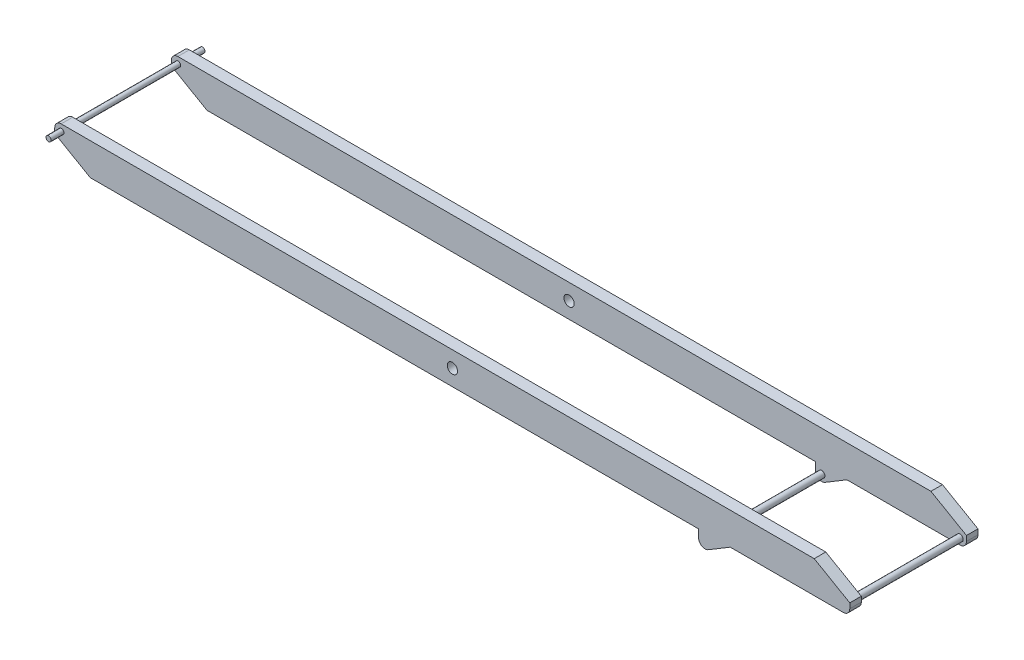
ISO-10303-21;
HEADER;
FILE_DESCRIPTION(('STEP AP214'),'2;1');
FILE_NAME('part.step','',(''),(''),'','','');
FILE_SCHEMA(('AUTOMOTIVE_DESIGN { 1 0 10303 214 1 1 1 1 }'));
ENDSEC;
DATA;
#1=APPLICATION_CONTEXT('core data for automotive mechanical design processes');
#2=APPLICATION_PROTOCOL_DEFINITION('international standard','automotive_design',2000,#1);
#3=PRODUCT_CONTEXT('',#1,'mechanical');
#4=PRODUCT('Part','Part','',(#3));
#5=PRODUCT_RELATED_PRODUCT_CATEGORY('part','',(#4));
#6=PRODUCT_DEFINITION_FORMATION('','',#4);
#7=PRODUCT_DEFINITION_CONTEXT('part definition',#1,'design');
#8=PRODUCT_DEFINITION('design','',#6,#7);
#9=PRODUCT_DEFINITION_SHAPE('','',#8);
#10=(LENGTH_UNIT() NAMED_UNIT(*) SI_UNIT(.MILLI.,.METRE.));
#11=(NAMED_UNIT(*) PLANE_ANGLE_UNIT() SI_UNIT($,.RADIAN.));
#12=(NAMED_UNIT(*) SI_UNIT($,.STERADIAN.) SOLID_ANGLE_UNIT());
#13=UNCERTAINTY_MEASURE_WITH_UNIT(LENGTH_MEASURE(1.E-05),#10,'distance_accuracy_value','');
#14=(GEOMETRIC_REPRESENTATION_CONTEXT(3) GLOBAL_UNCERTAINTY_ASSIGNED_CONTEXT((#13)) GLOBAL_UNIT_ASSIGNED_CONTEXT((#10,
#11,#12)) REPRESENTATION_CONTEXT('',''));
#15=CARTESIAN_POINT('',(0.,0.,0.));
#16=DIRECTION('',(0.,0.,1.));
#17=DIRECTION('',(1.,0.,0.));
#18=AXIS2_PLACEMENT_3D('',#15,#16,#17);
#19=CARTESIAN_POINT('',(0.,-50.,500.));
#20=DIRECTION('',(0.,1.,0.));
#21=DIRECTION('',(-1.,0.,0.));
#22=AXIS2_PLACEMENT_3D('',#19,#20,#21);
#23=PLANE('',#22);
#24=DIRECTION('',(1.,0.,0.));
#25=VECTOR('',#24,1.);
#26=CARTESIAN_POINT('',(0.,-50.,-500.));
#27=LINE('',#26,#25);
#28=CARTESIAN_POINT('',(-5872.87187078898,-50.0000000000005,-500.));
#29=VERTEX_POINT('',#28);
#30=CARTESIAN_POINT('',(-1128.91702187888,-50.0000000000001,-500.));
#31=VERTEX_POINT('',#30);
#32=EDGE_CURVE('E59',#29,#31,#27,.T.);
#33=ORIENTED_EDGE('',*,*,#32,.T.);
#34=DIRECTION('',(0.,0.,-1.));
#35=VECTOR('',#34,1.);
#36=CARTESIAN_POINT('',(-1128.91702187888,-50.0000000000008,5800.4428183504));
#37=LINE('',#36,#35);
#38=CARTESIAN_POINT('',(-1128.91702187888,-50.0000000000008,-410.));
#39=VERTEX_POINT('',#38);
#40=EDGE_CURVE('E234',#39,#31,#37,.T.);
#41=ORIENTED_EDGE('',*,*,#40,.F.);
#42=DIRECTION('',(-1.,0.,0.));
#43=VECTOR('',#42,1.);
#44=CARTESIAN_POINT('',(-6402.75656984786,-50.0000000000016,-410.));
#45=LINE('',#44,#43);
#46=CARTESIAN_POINT('',(-5872.87187078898,-50.0000000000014,-410.));
#47=VERTEX_POINT('',#46);
#48=EDGE_CURVE('E377',#39,#47,#45,.T.);
#49=ORIENTED_EDGE('',*,*,#48,.T.);
#50=DIRECTION('',(0.,0.,-1.));
#51=VECTOR('',#50,1.);
#52=CARTESIAN_POINT('',(-5872.87187078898,-50.0000000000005,500.));
#53=LINE('',#52,#51);
#54=EDGE_CURVE('E405',#47,#29,#53,.T.);
#55=ORIENTED_EDGE('',*,*,#54,.T.);
#56=EDGE_LOOP('',(#33,#41,#49,#55));
#57=FACE_BOUND('',#56,.T.);
#58=ADVANCED_FACE('F35',(#57),#23,.F.);
#59=CARTESIAN_POINT('',(-1078.91702187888,-110.000000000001,500.));
#60=DIRECTION('',(0.,0.,-1.));
#61=DIRECTION('',(-1.,0.,0.));
#62=AXIS2_PLACEMENT_3D('',#59,#60,#61);
#63=CYLINDRICAL_SURFACE('',#62,25.);
#64=CARTESIAN_POINT('',(-1078.91702187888,-110.000000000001,410.));
#65=DIRECTION('',(0.,0.,1.));
#66=DIRECTION('',(1.,0.,0.));
#67=AXIS2_PLACEMENT_3D('',#64,#65,#66);
#68=CIRCLE('',#67,25.);
#69=CARTESIAN_POINT('',(-1103.91702187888,-110.000000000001,410.));
#70=VERTEX_POINT('',#69);
#71=EDGE_CURVE('E44',#70,#70,#68,.F.);
#72=CARTESIAN_POINT('',(-1078.91702187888,-110.000000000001,-410.));
#73=DIRECTION('',(0.,0.,-1.));
#74=DIRECTION('',(-1.,0.,0.));
#75=AXIS2_PLACEMENT_3D('',#72,#73,#74);
#76=CIRCLE('',#75,25.);
#77=CARTESIAN_POINT('',(-1103.91702187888,-110.000000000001,-410.));
#78=VERTEX_POINT('',#77);
#79=EDGE_CURVE('E11',#78,#78,#76,.T.);
#80=CARTESIAN_POINT('',(-1103.91702187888,-110.000000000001,410.));
#81=CARTESIAN_POINT('',(-1103.91702187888,-110.000000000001,401.458333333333));
#82=CARTESIAN_POINT('',(-1103.91702187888,-110.000000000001,392.916666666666));
#83=CARTESIAN_POINT('',(-1103.91702187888,-110.000000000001,375.833333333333));
#84=CARTESIAN_POINT('',(-1103.91702187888,-110.000000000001,367.291666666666));
#85=CARTESIAN_POINT('',(-1103.91702187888,-110.000000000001,350.208333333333));
#86=CARTESIAN_POINT('',(-1103.91702187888,-110.000000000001,341.666666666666));
#87=CARTESIAN_POINT('',(-1103.91702187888,-110.000000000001,324.583333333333));
#88=CARTESIAN_POINT('',(-1103.91702187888,-110.000000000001,316.041666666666));
#89=CARTESIAN_POINT('',(-1103.91702187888,-110.000000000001,298.958333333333));
#90=CARTESIAN_POINT('',(-1103.91702187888,-110.000000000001,290.416666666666));
#91=CARTESIAN_POINT('',(-1103.91702187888,-110.000000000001,273.333333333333));
#92=CARTESIAN_POINT('',(-1103.91702187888,-110.000000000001,264.791666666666));
#93=CARTESIAN_POINT('',(-1103.91702187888,-110.000000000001,247.708333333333));
#94=CARTESIAN_POINT('',(-1103.91702187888,-110.000000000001,239.166666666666));
#95=CARTESIAN_POINT('',(-1103.91702187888,-110.000000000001,222.083333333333));
#96=CARTESIAN_POINT('',(-1103.91702187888,-110.000000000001,213.541666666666));
#97=CARTESIAN_POINT('',(-1103.91702187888,-110.000000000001,196.458333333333));
#98=CARTESIAN_POINT('',(-1103.91702187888,-110.000000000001,187.916666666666));
#99=CARTESIAN_POINT('',(-1103.91702187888,-110.000000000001,170.833333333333));
#100=CARTESIAN_POINT('',(-1103.91702187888,-110.000000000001,162.291666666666));
#101=CARTESIAN_POINT('',(-1103.91702187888,-110.000000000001,145.208333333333));
#102=CARTESIAN_POINT('',(-1103.91702187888,-110.000000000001,136.666666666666));
#103=CARTESIAN_POINT('',(-1103.91702187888,-110.000000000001,119.583333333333));
#104=CARTESIAN_POINT('',(-1103.91702187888,-110.000000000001,111.041666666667));
#105=CARTESIAN_POINT('',(-1103.91702187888,-110.000000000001,93.9583333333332));
#106=CARTESIAN_POINT('',(-1103.91702187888,-110.000000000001,85.4166666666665));
#107=CARTESIAN_POINT('',(-1103.91702187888,-110.000000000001,68.3333333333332));
#108=CARTESIAN_POINT('',(-1103.91702187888,-110.000000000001,59.7916666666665));
#109=CARTESIAN_POINT('',(-1103.91702187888,-110.000000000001,42.7083333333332));
#110=CARTESIAN_POINT('',(-1103.91702187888,-110.000000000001,34.1666666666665));
#111=CARTESIAN_POINT('',(-1103.91702187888,-110.000000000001,17.0833333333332));
#112=CARTESIAN_POINT('',(-1103.91702187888,-110.000000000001,8.54166666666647));
#113=CARTESIAN_POINT('',(-1103.91702187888,-110.000000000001,-8.54166666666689));
#114=CARTESIAN_POINT('',(-1103.91702187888,-110.000000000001,-17.0833333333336));
#115=CARTESIAN_POINT('',(-1103.91702187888,-110.000000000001,-34.1666666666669));
#116=CARTESIAN_POINT('',(-1103.91702187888,-110.000000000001,-42.7083333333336));
#117=CARTESIAN_POINT('',(-1103.91702187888,-110.000000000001,-59.7916666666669));
#118=CARTESIAN_POINT('',(-1103.91702187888,-110.000000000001,-68.3333333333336));
#119=CARTESIAN_POINT('',(-1103.91702187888,-110.000000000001,-85.4166666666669));
#120=CARTESIAN_POINT('',(-1103.91702187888,-110.000000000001,-93.9583333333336));
#121=CARTESIAN_POINT('',(-1103.91702187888,-110.000000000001,-111.041666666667));
#122=CARTESIAN_POINT('',(-1103.91702187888,-110.000000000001,-119.583333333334));
#123=CARTESIAN_POINT('',(-1103.91702187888,-110.000000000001,-136.666666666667));
#124=CARTESIAN_POINT('',(-1103.91702187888,-110.000000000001,-145.208333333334));
#125=CARTESIAN_POINT('',(-1103.91702187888,-110.000000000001,-162.291666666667));
#126=CARTESIAN_POINT('',(-1103.91702187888,-110.000000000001,-170.833333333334));
#127=CARTESIAN_POINT('',(-1103.91702187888,-110.000000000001,-187.916666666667));
#128=CARTESIAN_POINT('',(-1103.91702187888,-110.000000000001,-196.458333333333));
#129=CARTESIAN_POINT('',(-1103.91702187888,-110.000000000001,-213.541666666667));
#130=CARTESIAN_POINT('',(-1103.91702187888,-110.000000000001,-222.083333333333));
#131=CARTESIAN_POINT('',(-1103.91702187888,-110.000000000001,-239.166666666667));
#132=CARTESIAN_POINT('',(-1103.91702187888,-110.000000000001,-247.708333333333));
#133=CARTESIAN_POINT('',(-1103.91702187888,-110.000000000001,-264.791666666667));
#134=CARTESIAN_POINT('',(-1103.91702187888,-110.000000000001,-273.333333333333));
#135=CARTESIAN_POINT('',(-1103.91702187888,-110.000000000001,-290.416666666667));
#136=CARTESIAN_POINT('',(-1103.91702187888,-110.000000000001,-298.958333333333));
#137=CARTESIAN_POINT('',(-1103.91702187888,-110.000000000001,-316.041666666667));
#138=CARTESIAN_POINT('',(-1103.91702187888,-110.000000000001,-324.583333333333));
#139=CARTESIAN_POINT('',(-1103.91702187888,-110.000000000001,-341.666666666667));
#140=CARTESIAN_POINT('',(-1103.91702187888,-110.000000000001,-350.208333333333));
#141=CARTESIAN_POINT('',(-1103.91702187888,-110.000000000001,-367.291666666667));
#142=CARTESIAN_POINT('',(-1103.91702187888,-110.000000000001,-375.833333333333));
#143=CARTESIAN_POINT('',(-1103.91702187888,-110.000000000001,-392.916666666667));
#144=CARTESIAN_POINT('',(-1103.91702187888,-110.000000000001,-401.458333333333));
#145=CARTESIAN_POINT('',(-1103.91702187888,-110.000000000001,-410.));
#146=B_SPLINE_CURVE_WITH_KNOTS('',3,(#80,#81,#82,#83,#84,#85,#86,#87,#88,#89,#90,#91,#92,#93,
#94,#95,#96,#97,#98,#99,#100,#101,#102,#103,#104,#105,#106,#107,#108,#109,#110,#111,#112,#113,
#114,#115,#116,#117,#118,#119,#120,#121,#122,#123,#124,#125,#126,#127,#128,#129,#130,#131,#132,
#133,#134,#135,#136,#137,#138,#139,#140,#141,#142,#143,#144,#145),.UNSPECIFIED.,.F.,.F.,(4,2,2,
2,2,2,2,2,2,2,2,2,2,2,2,2,2,2,2,2,2,2,2,2,2,2,2,2,2,2,2,2,4),(0.,25.625,51.25,76.875,102.5,
128.125,153.75,179.375,205.,230.625,256.25,281.875,307.5,333.125,358.75,384.375,410.,435.625,
461.25,486.875,512.5,538.125,563.75,589.375,615.,640.625,666.25,691.875,717.5,743.125,768.75,
794.375,820.),.UNSPECIFIED.);
#147=EDGE_CURVE('BSEAM420',#70,#78,#146,.T.);
#148=ORIENTED_EDGE('',*,*,#71,.T.);
#149=ORIENTED_EDGE('',*,*,#79,.F.);
#150=ORIENTED_EDGE('',*,*,#147,.T.);
#151=ORIENTED_EDGE('',*,*,#147,.F.);
#152=EDGE_LOOP('',(#148,#150,#149,#151));
#153=FACE_BOUND('',#152,.T.);
#154=ADVANCED_FACE('F420',(#153),#63,.T.);
#155=CARTESIAN_POINT('',(-6402.75656984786,-50.0000000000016,410.));
#156=DIRECTION('',(0.,0.,1.));
#157=DIRECTION('',(1.,0.,0.));
#158=AXIS2_PLACEMENT_3D('',#155,#156,#157);
#159=PLANE('',#158);
#160=CARTESIAN_POINT('',(-3049.07772941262,75.0000000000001,410.));
#161=DIRECTION('',(0.,0.,1.));
#162=DIRECTION('',(1.,0.,0.));
#163=AXIS2_PLACEMENT_3D('',#160,#161,#162);
#164=CIRCLE('',#163,39.9999999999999);
#165=CARTESIAN_POINT('',(-3009.07772941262,75.0000000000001,410.));
#166=VERTEX_POINT('',#165);
#167=EDGE_CURVE('E224',#166,#166,#164,.T.);
#168=ORIENTED_EDGE('',*,*,#167,.T.);
#169=EDGE_LOOP('',(#168));
#170=FACE_BOUND('',#169,.T.);
#171=CARTESIAN_POINT('',(-6098.15545882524,149.999999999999,410.));
#172=DIRECTION('',(0.,0.,1.));
#173=DIRECTION('',(1.,0.,0.));
#174=AXIS2_PLACEMENT_3D('',#171,#172,#173);
#175=CIRCLE('',#174,19.9999999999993);
#176=CARTESIAN_POINT('',(-6118.15545882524,149.999999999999,410.));
#177=VERTEX_POINT('',#176);
#178=EDGE_CURVE('E402',#177,#177,#175,.T.);
#179=ORIENTED_EDGE('',*,*,#178,.T.);
#180=EDGE_LOOP('',(#179));
#181=FACE_BOUND('',#180,.T.);
#182=CARTESIAN_POINT('',(0.,0.,410.));
#183=DIRECTION('',(0.,0.,1.));
#184=DIRECTION('',(1.,0.,0.));
#185=AXIS2_PLACEMENT_3D('',#182,#183,#184);
#186=CIRCLE('',#185,25.);
#187=CARTESIAN_POINT('',(-25.,0.,410.));
#188=VERTEX_POINT('',#187);
#189=EDGE_CURVE('E263',#188,#188,#186,.F.);
#190=ORIENTED_EDGE('',*,*,#189,.F.);
#191=EDGE_LOOP('',(#190));
#192=FACE_BOUND('',#191,.T.);
#193=DIRECTION('',(1.,0.,0.));
#194=VECTOR('',#193,1.);
#195=CARTESIAN_POINT('',(-6402.75656984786,-50.0000000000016,410.));
#196=LINE('',#195,#194);
#197=CARTESIAN_POINT('',(-881.951293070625,-50.0000000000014,410.));
#198=VERTEX_POINT('',#197);
#199=CARTESIAN_POINT('',(0.,-50.0000000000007,410.));
#200=VERTEX_POINT('',#199);
#201=EDGE_CURVE('E273',#198,#200,#196,.T.);
#202=ORIENTED_EDGE('',*,*,#201,.F.);
#203=DIRECTION('',(-0.857205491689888,-0.514974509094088,0.));
#204=VECTOR('',#203,1.);
#205=CARTESIAN_POINT('',(-837.178155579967,-23.1021036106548,410.));
#206=LINE('',#205,#204);
#207=CARTESIAN_POINT('',(-1053.16829642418,-152.860274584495,410.));
#208=VERTEX_POINT('',#207);
#209=EDGE_CURVE('E244',#198,#208,#206,.T.);
#210=ORIENTED_EDGE('',*,*,#209,.T.);
#211=CARTESIAN_POINT('',(-1078.91702187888,-110.000000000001,410.));
#212=DIRECTION('',(0.,0.,1.));
#213=DIRECTION('',(1.,0.,0.));
#214=AXIS2_PLACEMENT_3D('',#211,#212,#213);
#215=CIRCLE('',#214,50.);
#216=CARTESIAN_POINT('',(-1128.91702187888,-110.000000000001,410.));
#217=VERTEX_POINT('',#216);
#218=EDGE_CURVE('E241',#208,#217,#215,.F.);
#219=ORIENTED_EDGE('',*,*,#218,.T.);
#220=DIRECTION('',(0.,1.,0.));
#221=VECTOR('',#220,1.);
#222=CARTESIAN_POINT('',(-1128.91702187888,-110.000000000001,410.));
#223=LINE('',#222,#221);
#224=CARTESIAN_POINT('',(-1128.91702187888,-50.0000000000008,410.));
#225=VERTEX_POINT('',#224);
#226=EDGE_CURVE('E238',#217,#225,#223,.T.);
#227=ORIENTED_EDGE('',*,*,#226,.T.);
#228=CARTESIAN_POINT('',(-5872.87187078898,-50.0000000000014,410.));
#229=VERTEX_POINT('',#228);
#230=EDGE_CURVE('E270',#229,#225,#196,.T.);
#231=ORIENTED_EDGE('',*,*,#230,.F.);
#232=DIRECTION('',(0.866025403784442,-0.499999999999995,0.));
#233=VECTOR('',#232,1.);
#234=CARTESIAN_POINT('',(-6150.,109.999999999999,410.));
#235=LINE('',#234,#233);
#236=CARTESIAN_POINT('',(-6150.,109.999999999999,410.));
#237=VERTEX_POINT('',#236);
#238=EDGE_CURVE('E283',#237,#229,#235,.T.);
#239=ORIENTED_EDGE('',*,*,#238,.F.);
#240=DIRECTION('',(0.,-1.,0.));
#241=VECTOR('',#240,1.);
#242=CARTESIAN_POINT('',(-6150.,149.999999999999,410.));
#243=LINE('',#242,#241);
#244=CARTESIAN_POINT('',(-6150.,149.999999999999,410.));
#245=VERTEX_POINT('',#244);
#246=EDGE_CURVE('E286',#245,#237,#243,.T.);
#247=ORIENTED_EDGE('',*,*,#246,.F.);
#248=CARTESIAN_POINT('',(-6100.,149.999999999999,410.));
#249=DIRECTION('',(0.,0.,1.));
#250=DIRECTION('',(1.,0.,0.));
#251=AXIS2_PLACEMENT_3D('',#248,#249,#250);
#252=CIRCLE('',#251,49.9999999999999);
#253=CARTESIAN_POINT('',(-6100.,199.999999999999,410.));
#254=VERTEX_POINT('',#253);
#255=EDGE_CURVE('E289',#254,#245,#252,.T.);
#256=ORIENTED_EDGE('',*,*,#255,.F.);
#257=DIRECTION('',(1.,0.,0.));
#258=VECTOR('',#257,1.);
#259=CARTESIAN_POINT('',(-6402.75656984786,199.999999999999,410.));
#260=LINE('',#259,#258);
#261=CARTESIAN_POINT('',(-227.128129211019,200.,410.));
#262=VERTEX_POINT('',#261);
#263=EDGE_CURVE('E269',#254,#262,#260,.T.);
#264=ORIENTED_EDGE('',*,*,#263,.T.);
#265=DIRECTION('',(-0.866025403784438,0.500000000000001,0.));
#266=VECTOR('',#265,1.);
#267=CARTESIAN_POINT('',(50.,40.,410.));
#268=LINE('',#267,#266);
#269=CARTESIAN_POINT('',(50.,40.,410.));
#270=VERTEX_POINT('',#269);
#271=EDGE_CURVE('E272',#270,#262,#268,.T.);
#272=ORIENTED_EDGE('',*,*,#271,.F.);
#273=DIRECTION('',(0.,1.,0.));
#274=VECTOR('',#273,1.);
#275=CARTESIAN_POINT('',(50.,0.,410.));
#276=LINE('',#275,#274);
#277=CARTESIAN_POINT('',(50.,0.,410.));
#278=VERTEX_POINT('',#277);
#279=EDGE_CURVE('E277',#278,#270,#276,.T.);
#280=ORIENTED_EDGE('',*,*,#279,.F.);
#281=CARTESIAN_POINT('',(0.,0.,410.));
#282=DIRECTION('',(0.,0.,1.));
#283=DIRECTION('',(1.,0.,0.));
#284=AXIS2_PLACEMENT_3D('',#281,#282,#283);
#285=CIRCLE('',#284,50.);
#286=EDGE_CURVE('E280',#200,#278,#285,.T.);
#287=ORIENTED_EDGE('',*,*,#286,.F.);
#288=EDGE_LOOP('',(#202,#210,#219,#227,#231,#239,#247,#256,#264,#272,#280,#287));
#289=FACE_BOUND('',#288,.T.);
#290=ORIENTED_EDGE('',*,*,#71,.F.);
#291=EDGE_LOOP('',(#290));
#292=FACE_BOUND('',#291,.T.);
#293=ADVANCED_FACE('F423',(#170,#181,#192,#289,#292),#159,.F.);
#294=CARTESIAN_POINT('',(0.,-50.,500.));
#295=DIRECTION('',(0.,1.,0.));
#296=DIRECTION('',(-1.,0.,0.));
#297=AXIS2_PLACEMENT_3D('',#294,#295,#296);
#298=PLANE('',#297);
#299=ORIENTED_EDGE('',*,*,#230,.T.);
#300=DIRECTION('',(0.,0.,1.));
#301=VECTOR('',#300,1.);
#302=CARTESIAN_POINT('',(-1128.91702187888,-50.0000000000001,500.));
#303=LINE('',#302,#301);
#304=CARTESIAN_POINT('',(-1128.91702187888,-50.0000000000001,500.));
#305=VERTEX_POINT('',#304);
#306=EDGE_CURVE('E261',#225,#305,#303,.T.);
#307=ORIENTED_EDGE('',*,*,#306,.T.);
#308=DIRECTION('',(1.,0.,0.));
#309=VECTOR('',#308,1.);
#310=CARTESIAN_POINT('',(0.,-50.,500.));
#311=LINE('',#310,#309);
#312=CARTESIAN_POINT('',(-5872.87187078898,-50.0000000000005,500.));
#313=VERTEX_POINT('',#312);
#314=EDGE_CURVE('E303',#313,#305,#311,.T.);
#315=ORIENTED_EDGE('',*,*,#314,.F.);
#316=DIRECTION('',(0.,0.,-1.));
#317=VECTOR('',#316,1.);
#318=CARTESIAN_POINT('',(-5872.87187078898,-50.0000000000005,500.));
#319=LINE('',#318,#317);
#320=EDGE_CURVE('E331',#313,#229,#319,.T.);
#321=ORIENTED_EDGE('',*,*,#320,.T.);
#322=EDGE_LOOP('',(#299,#307,#315,#321));
#323=FACE_BOUND('',#322,.T.);
#324=ADVANCED_FACE('F425',(#323),#298,.F.);
#325=CARTESIAN_POINT('',(-6098.15545882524,149.999999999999,600.));
#326=DIRECTION('',(0.,0.,-1.));
#327=DIRECTION('',(-1.,0.,0.));
#328=AXIS2_PLACEMENT_3D('',#325,#326,#327);
#329=CYLINDRICAL_SURFACE('',#328,19.9999999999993);
#330=CARTESIAN_POINT('',(-6098.15545882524,149.999999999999,-410.));
#331=DIRECTION('',(0.,0.,-1.));
#332=DIRECTION('',(-1.,0.,0.));
#333=AXIS2_PLACEMENT_3D('',#330,#331,#332);
#334=CIRCLE('',#333,19.9999999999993);
#335=CARTESIAN_POINT('',(-6118.15545882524,149.999999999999,-410.));
#336=VERTEX_POINT('',#335);
#337=EDGE_CURVE('E344',#336,#336,#334,.F.);
#338=CARTESIAN_POINT('',(-6118.15545882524,149.999999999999,-410.));
#339=CARTESIAN_POINT('',(-6118.15545882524,149.999999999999,-401.458333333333));
#340=CARTESIAN_POINT('',(-6118.15545882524,149.999999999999,-392.916666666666));
#341=CARTESIAN_POINT('',(-6118.15545882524,149.999999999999,-375.833333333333));
#342=CARTESIAN_POINT('',(-6118.15545882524,149.999999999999,-367.291666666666));
#343=CARTESIAN_POINT('',(-6118.15545882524,149.999999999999,-350.208333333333));
#344=CARTESIAN_POINT('',(-6118.15545882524,149.999999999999,-341.666666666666));
#345=CARTESIAN_POINT('',(-6118.15545882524,149.999999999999,-324.583333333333));
#346=CARTESIAN_POINT('',(-6118.15545882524,149.999999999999,-316.041666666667));
#347=CARTESIAN_POINT('',(-6118.15545882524,149.999999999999,-298.958333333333));
#348=CARTESIAN_POINT('',(-6118.15545882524,149.999999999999,-290.416666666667));
#349=CARTESIAN_POINT('',(-6118.15545882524,149.999999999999,-273.333333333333));
#350=CARTESIAN_POINT('',(-6118.15545882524,149.999999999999,-264.791666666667));
#351=CARTESIAN_POINT('',(-6118.15545882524,149.999999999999,-247.708333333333));
#352=CARTESIAN_POINT('',(-6118.15545882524,149.999999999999,-239.166666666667));
#353=CARTESIAN_POINT('',(-6118.15545882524,149.999999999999,-222.083333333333));
#354=CARTESIAN_POINT('',(-6118.15545882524,149.999999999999,-213.541666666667));
#355=CARTESIAN_POINT('',(-6118.15545882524,149.999999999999,-196.458333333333));
#356=CARTESIAN_POINT('',(-6118.15545882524,149.999999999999,-187.916666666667));
#357=CARTESIAN_POINT('',(-6118.15545882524,149.999999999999,-170.833333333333));
#358=CARTESIAN_POINT('',(-6118.15545882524,149.999999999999,-162.291666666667));
#359=CARTESIAN_POINT('',(-6118.15545882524,149.999999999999,-145.208333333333));
#360=CARTESIAN_POINT('',(-6118.15545882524,149.999999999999,-136.666666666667));
#361=CARTESIAN_POINT('',(-6118.15545882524,149.999999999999,-119.583333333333));
#362=CARTESIAN_POINT('',(-6118.15545882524,149.999999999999,-111.041666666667));
#363=CARTESIAN_POINT('',(-6118.15545882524,149.999999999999,-93.9583333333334));
#364=CARTESIAN_POINT('',(-6118.15545882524,149.999999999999,-85.4166666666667));
#365=CARTESIAN_POINT('',(-6118.15545882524,149.999999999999,-68.3333333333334));
#366=CARTESIAN_POINT('',(-6118.15545882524,149.999999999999,-59.7916666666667));
#367=CARTESIAN_POINT('',(-6118.15545882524,149.999999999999,-42.7083333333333));
#368=CARTESIAN_POINT('',(-6118.15545882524,149.999999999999,-34.1666666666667));
#369=CARTESIAN_POINT('',(-6118.15545882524,149.999999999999,-17.0833333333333));
#370=CARTESIAN_POINT('',(-6118.15545882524,149.999999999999,-8.54166666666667));
#371=CARTESIAN_POINT('',(-6118.15545882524,149.999999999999,8.54166666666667));
#372=CARTESIAN_POINT('',(-6118.15545882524,149.999999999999,17.0833333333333));
#373=CARTESIAN_POINT('',(-6118.15545882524,149.999999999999,34.1666666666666));
#374=CARTESIAN_POINT('',(-6118.15545882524,149.999999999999,42.7083333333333));
#375=CARTESIAN_POINT('',(-6118.15545882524,149.999999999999,59.7916666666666));
#376=CARTESIAN_POINT('',(-6118.15545882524,149.999999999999,68.3333333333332));
#377=CARTESIAN_POINT('',(-6118.15545882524,149.999999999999,85.4166666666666));
#378=CARTESIAN_POINT('',(-6118.15545882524,149.999999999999,93.9583333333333));
#379=CARTESIAN_POINT('',(-6118.15545882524,149.999999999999,111.041666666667));
#380=CARTESIAN_POINT('',(-6118.15545882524,149.999999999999,119.583333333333));
#381=CARTESIAN_POINT('',(-6118.15545882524,149.999999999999,136.666666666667));
#382=CARTESIAN_POINT('',(-6118.15545882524,149.999999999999,145.208333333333));
#383=CARTESIAN_POINT('',(-6118.15545882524,149.999999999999,162.291666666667));
#384=CARTESIAN_POINT('',(-6118.15545882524,149.999999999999,170.833333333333));
#385=CARTESIAN_POINT('',(-6118.15545882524,149.999999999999,187.916666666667));
#386=CARTESIAN_POINT('',(-6118.15545882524,149.999999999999,196.458333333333));
#387=CARTESIAN_POINT('',(-6118.15545882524,149.999999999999,213.541666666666));
#388=CARTESIAN_POINT('',(-6118.15545882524,149.999999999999,222.083333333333));
#389=CARTESIAN_POINT('',(-6118.15545882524,149.999999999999,239.166666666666));
#390=CARTESIAN_POINT('',(-6118.15545882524,149.999999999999,247.708333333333));
#391=CARTESIAN_POINT('',(-6118.15545882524,149.999999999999,264.791666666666));
#392=CARTESIAN_POINT('',(-6118.15545882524,149.999999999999,273.333333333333));
#393=CARTESIAN_POINT('',(-6118.15545882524,149.999999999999,290.416666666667));
#394=CARTESIAN_POINT('',(-6118.15545882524,149.999999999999,298.958333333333));
#395=CARTESIAN_POINT('',(-6118.15545882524,149.999999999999,316.041666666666));
#396=CARTESIAN_POINT('',(-6118.15545882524,149.999999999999,324.583333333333));
#397=CARTESIAN_POINT('',(-6118.15545882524,149.999999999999,341.666666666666));
#398=CARTESIAN_POINT('',(-6118.15545882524,149.999999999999,350.208333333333));
#399=CARTESIAN_POINT('',(-6118.15545882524,149.999999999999,367.291666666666));
#400=CARTESIAN_POINT('',(-6118.15545882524,149.999999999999,375.833333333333));
#401=CARTESIAN_POINT('',(-6118.15545882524,149.999999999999,392.916666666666));
#402=CARTESIAN_POINT('',(-6118.15545882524,149.999999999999,401.458333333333));
#403=CARTESIAN_POINT('',(-6118.15545882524,149.999999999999,410.));
#404=B_SPLINE_CURVE_WITH_KNOTS('',3,(#338,#339,#340,#341,#342,#343,#344,#345,#346,#347,#348,
#349,#350,#351,#352,#353,#354,#355,#356,#357,#358,#359,#360,#361,#362,#363,#364,#365,#366,#367,
#368,#369,#370,#371,#372,#373,#374,#375,#376,#377,#378,#379,#380,#381,#382,#383,#384,#385,#386,
#387,#388,#389,#390,#391,#392,#393,#394,#395,#396,#397,#398,#399,#400,#401,#402,#403),
.UNSPECIFIED.,.F.,.F.,(4,2,2,2,2,2,2,2,2,2,2,2,2,2,2,2,2,2,2,2,2,2,2,2,2,2,2,2,2,2,2,2,4),(0.,
25.625,51.25,76.875,102.5,128.125,153.75,179.375,205.,230.625,256.25,281.875,307.5,333.125,
358.75,384.375,410.,435.625,461.25,486.875,512.5,538.125,563.75,589.375,615.,640.625,666.25,
691.875,717.5,743.124999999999,768.75,794.375,820.),.UNSPECIFIED.);
#405=EDGE_CURVE('BSEAM432',#336,#177,#404,.T.);
#406=ORIENTED_EDGE('',*,*,#337,.T.);
#407=ORIENTED_EDGE('',*,*,#178,.F.);
#408=ORIENTED_EDGE('',*,*,#405,.T.);
#409=ORIENTED_EDGE('',*,*,#405,.F.);
#410=EDGE_LOOP('',(#406,#408,#407,#409));
#411=FACE_BOUND('',#410,.T.);
#412=ADVANCED_FACE('F432',(#411),#329,.T.);
#413=CARTESIAN_POINT('',(-6100.,149.999999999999,500.));
#414=DIRECTION('',(0.,0.,-1.));
#415=DIRECTION('',(-1.,0.,0.));
#416=AXIS2_PLACEMENT_3D('',#413,#414,#415);
#417=CYLINDRICAL_SURFACE('',#416,49.9999999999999);
#418=DIRECTION('',(0.,0.,-1.));
#419=VECTOR('',#418,1.);
#420=CARTESIAN_POINT('',(-6150.,149.999999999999,500.));
#421=LINE('',#420,#419);
#422=CARTESIAN_POINT('',(-6150.,149.999999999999,-410.));
#423=VERTEX_POINT('',#422);
#424=CARTESIAN_POINT('',(-6150.,149.999999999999,-500.));
#425=VERTEX_POINT('',#424);
#426=EDGE_CURVE('E383',#423,#425,#421,.T.);
#427=ORIENTED_EDGE('',*,*,#426,.F.);
#428=CARTESIAN_POINT('',(-6100.,149.999999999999,-410.));
#429=DIRECTION('',(0.,0.,-1.));
#430=DIRECTION('',(-1.,0.,0.));
#431=AXIS2_PLACEMENT_3D('',#428,#429,#430);
#432=CIRCLE('',#431,49.9999999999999);
#433=CARTESIAN_POINT('',(-6100.,199.999999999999,-410.));
#434=VERTEX_POINT('',#433);
#435=EDGE_CURVE('E352',#423,#434,#432,.T.);
#436=ORIENTED_EDGE('',*,*,#435,.T.);
#437=DIRECTION('',(0.,0.,-1.));
#438=VECTOR('',#437,1.);
#439=CARTESIAN_POINT('',(-6100.,199.999999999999,500.));
#440=LINE('',#439,#438);
#441=CARTESIAN_POINT('',(-6100.,199.999999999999,-500.));
#442=VERTEX_POINT('',#441);
#443=EDGE_CURVE('E388',#434,#442,#440,.T.);
#444=ORIENTED_EDGE('',*,*,#443,.T.);
#445=CARTESIAN_POINT('',(-6100.,149.999999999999,-500.));
#446=DIRECTION('',(0.,0.,1.));
#447=DIRECTION('',(1.,0.,0.));
#448=AXIS2_PLACEMENT_3D('',#445,#446,#447);
#449=CIRCLE('',#448,49.9999999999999);
#450=EDGE_CURVE('E384',#442,#425,#449,.T.);
#451=ORIENTED_EDGE('',*,*,#450,.T.);
#452=EDGE_LOOP('',(#427,#436,#444,#451));
#453=FACE_BOUND('',#452,.T.);
#454=ADVANCED_FACE('F37',(#453),#417,.T.);
#455=CARTESIAN_POINT('',(-6150.,149.999999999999,500.));
#456=DIRECTION('',(1.,0.,0.));
#457=DIRECTION('',(0.,0.,-1.));
#458=AXIS2_PLACEMENT_3D('',#455,#456,#457);
#459=PLANE('',#458);
#460=DIRECTION('',(0.,0.,-1.));
#461=VECTOR('',#460,1.);
#462=CARTESIAN_POINT('',(-6150.,109.999999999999,500.));
#463=LINE('',#462,#461);
#464=CARTESIAN_POINT('',(-6150.,109.999999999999,-410.));
#465=VERTEX_POINT('',#464);
#466=CARTESIAN_POINT('',(-6150.,109.999999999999,-500.));
#467=VERTEX_POINT('',#466);
#468=EDGE_CURVE('E378',#465,#467,#463,.T.);
#469=ORIENTED_EDGE('',*,*,#468,.F.);
#470=DIRECTION('',(0.,1.,0.));
#471=VECTOR('',#470,1.);
#472=CARTESIAN_POINT('',(-6150.,149.999999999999,-410.));
#473=LINE('',#472,#471);
#474=EDGE_CURVE('E387',#465,#423,#473,.T.);
#475=ORIENTED_EDGE('',*,*,#474,.T.);
#476=ORIENTED_EDGE('',*,*,#426,.T.);
#477=DIRECTION('',(0.,-1.,0.));
#478=VECTOR('',#477,1.);
#479=CARTESIAN_POINT('',(-6150.,149.999999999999,-500.));
#480=LINE('',#479,#478);
#481=EDGE_CURVE('E379',#425,#467,#480,.T.);
#482=ORIENTED_EDGE('',*,*,#481,.T.);
#483=EDGE_LOOP('',(#469,#475,#476,#482));
#484=FACE_BOUND('',#483,.T.);
#485=ADVANCED_FACE('F456',(#484),#459,.F.);
#486=CARTESIAN_POINT('',(-6150.,109.999999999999,500.));
#487=DIRECTION('',(0.499999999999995,0.866025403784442,0.));
#488=DIRECTION('',(-0.866025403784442,0.499999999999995,0.));
#489=AXIS2_PLACEMENT_3D('',#486,#487,#488);
#490=PLANE('',#489);
#491=ORIENTED_EDGE('',*,*,#54,.F.);
#492=DIRECTION('',(-0.866025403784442,0.499999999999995,0.));
#493=VECTOR('',#492,1.);
#494=CARTESIAN_POINT('',(-6150.,109.999999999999,-410.));
#495=LINE('',#494,#493);
#496=EDGE_CURVE('E382',#47,#465,#495,.T.);
#497=ORIENTED_EDGE('',*,*,#496,.T.);
#498=ORIENTED_EDGE('',*,*,#468,.T.);
#499=DIRECTION('',(0.866025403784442,-0.499999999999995,0.));
#500=VECTOR('',#499,1.);
#501=CARTESIAN_POINT('',(-6150.,109.999999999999,-500.));
#502=LINE('',#501,#500);
#503=EDGE_CURVE('E374',#467,#29,#502,.T.);
#504=ORIENTED_EDGE('',*,*,#503,.T.);
#505=EDGE_LOOP('',(#491,#497,#498,#504));
#506=FACE_BOUND('',#505,.T.);
#507=ADVANCED_FACE('F449',(#506),#490,.F.);
#508=CARTESIAN_POINT('',(0.,-50.0000000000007,-410.));
#509=VERTEX_POINT('',#508);
#510=CARTESIAN_POINT('',(-881.951293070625,-50.0000000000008,-410.));
#511=VERTEX_POINT('',#510);
#512=EDGE_CURVE('E403',#509,#511,#45,.T.);
#513=ORIENTED_EDGE('',*,*,#512,.T.);
#514=DIRECTION('',(0.,0.,-1.));
#515=VECTOR('',#514,1.);
#516=CARTESIAN_POINT('',(-881.951293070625,-50.0000000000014,5800.4428183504));
#517=LINE('',#516,#515);
#518=CARTESIAN_POINT('',(-881.951293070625,-50.0000000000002,-500.));
#519=VERTEX_POINT('',#518);
#520=EDGE_CURVE('E51',#511,#519,#517,.T.);
#521=ORIENTED_EDGE('',*,*,#520,.T.);
#522=CARTESIAN_POINT('',(0.,-50.,-500.));
#523=VERTEX_POINT('',#522);
#524=EDGE_CURVE('E223',#519,#523,#27,.T.);
#525=ORIENTED_EDGE('',*,*,#524,.T.);
#526=DIRECTION('',(0.,0.,-1.));
#527=VECTOR('',#526,1.);
#528=CARTESIAN_POINT('',(0.,-50.,500.));
#529=LINE('',#528,#527);
#530=EDGE_CURVE('E371',#509,#523,#529,.T.);
#531=ORIENTED_EDGE('',*,*,#530,.F.);
#532=EDGE_LOOP('',(#513,#521,#525,#531));
#533=FACE_BOUND('',#532,.T.);
#534=ADVANCED_FACE('F442',(#533),#23,.F.);
#535=CARTESIAN_POINT('',(0.,0.,500.));
#536=DIRECTION('',(0.,0.,-1.));
#537=DIRECTION('',(-1.,0.,0.));
#538=AXIS2_PLACEMENT_3D('',#535,#536,#537);
#539=CYLINDRICAL_SURFACE('',#538,50.);
#540=DIRECTION('',(0.,0.,-1.));
#541=VECTOR('',#540,1.);
#542=CARTESIAN_POINT('',(50.,0.,500.));
#543=LINE('',#542,#541);
#544=CARTESIAN_POINT('',(50.,0.,-410.));
#545=VERTEX_POINT('',#544);
#546=CARTESIAN_POINT('',(50.,0.,-500.));
#547=VERTEX_POINT('',#546);
#548=EDGE_CURVE('E366',#545,#547,#543,.T.);
#549=ORIENTED_EDGE('',*,*,#548,.F.);
#550=CARTESIAN_POINT('',(0.,0.,-410.));
#551=DIRECTION('',(0.,0.,-1.));
#552=DIRECTION('',(-1.,0.,0.));
#553=AXIS2_PLACEMENT_3D('',#550,#551,#552);
#554=CIRCLE('',#553,50.);
#555=EDGE_CURVE('E373',#545,#509,#554,.T.);
#556=ORIENTED_EDGE('',*,*,#555,.T.);
#557=ORIENTED_EDGE('',*,*,#530,.T.);
#558=CARTESIAN_POINT('',(0.,0.,-500.));
#559=DIRECTION('',(0.,0.,1.));
#560=DIRECTION('',(1.,0.,0.));
#561=AXIS2_PLACEMENT_3D('',#558,#559,#560);
#562=CIRCLE('',#561,50.);
#563=EDGE_CURVE('E367',#523,#547,#562,.T.);
#564=ORIENTED_EDGE('',*,*,#563,.T.);
#565=EDGE_LOOP('',(#549,#556,#557,#564));
#566=FACE_BOUND('',#565,.T.);
#567=ADVANCED_FACE('F448',(#566),#539,.T.);
#568=CARTESIAN_POINT('',(50.,0.,500.));
#569=DIRECTION('',(-1.,0.,0.));
#570=DIRECTION('',(0.,-1.,0.));
#571=AXIS2_PLACEMENT_3D('',#568,#569,#570);
#572=PLANE('',#571);
#573=DIRECTION('',(0.,0.,-1.));
#574=VECTOR('',#573,1.);
#575=CARTESIAN_POINT('',(50.,40.,500.));
#576=LINE('',#575,#574);
#577=CARTESIAN_POINT('',(50.,40.,-410.));
#578=VERTEX_POINT('',#577);
#579=CARTESIAN_POINT('',(50.,40.,-500.));
#580=VERTEX_POINT('',#579);
#581=EDGE_CURVE('E361',#578,#580,#576,.T.);
#582=ORIENTED_EDGE('',*,*,#581,.F.);
#583=DIRECTION('',(0.,-1.,0.));
#584=VECTOR('',#583,1.);
#585=CARTESIAN_POINT('',(50.,0.,-410.));
#586=LINE('',#585,#584);
#587=EDGE_CURVE('E370',#578,#545,#586,.T.);
#588=ORIENTED_EDGE('',*,*,#587,.T.);
#589=ORIENTED_EDGE('',*,*,#548,.T.);
#590=DIRECTION('',(0.,1.,0.));
#591=VECTOR('',#590,1.);
#592=CARTESIAN_POINT('',(50.,0.,-500.));
#593=LINE('',#592,#591);
#594=EDGE_CURVE('E362',#547,#580,#593,.T.);
#595=ORIENTED_EDGE('',*,*,#594,.T.);
#596=EDGE_LOOP('',(#582,#588,#589,#595));
#597=FACE_BOUND('',#596,.T.);
#598=ADVANCED_FACE('F454',(#597),#572,.F.);
#599=CARTESIAN_POINT('',(50.,40.,500.));
#600=DIRECTION('',(-0.500000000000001,-0.866025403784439,0.));
#601=DIRECTION('',(0.866025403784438,-0.500000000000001,0.));
#602=AXIS2_PLACEMENT_3D('',#599,#600,#601);
#603=PLANE('',#602);
#604=DIRECTION('',(0.,0.,-1.));
#605=VECTOR('',#604,1.);
#606=CARTESIAN_POINT('',(-227.12812921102,200.,500.));
#607=LINE('',#606,#605);
#608=CARTESIAN_POINT('',(-227.12812921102,200.,-410.));
#609=VERTEX_POINT('',#608);
#610=CARTESIAN_POINT('',(-227.12812921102,200.,-500.));
#611=VERTEX_POINT('',#610);
#612=EDGE_CURVE('E357',#609,#611,#607,.T.);
#613=ORIENTED_EDGE('',*,*,#612,.F.);
#614=DIRECTION('',(0.866025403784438,-0.500000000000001,0.));
#615=VECTOR('',#614,1.);
#616=CARTESIAN_POINT('',(50.,40.,-410.));
#617=LINE('',#616,#615);
#618=EDGE_CURVE('E365',#609,#578,#617,.T.);
#619=ORIENTED_EDGE('',*,*,#618,.T.);
#620=ORIENTED_EDGE('',*,*,#581,.T.);
#621=DIRECTION('',(-0.866025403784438,0.500000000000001,0.));
#622=VECTOR('',#621,1.);
#623=CARTESIAN_POINT('',(50.,40.,-500.));
#624=LINE('',#623,#622);
#625=EDGE_CURVE('E358',#580,#611,#624,.T.);
#626=ORIENTED_EDGE('',*,*,#625,.T.);
#627=EDGE_LOOP('',(#613,#619,#620,#626));
#628=FACE_BOUND('',#627,.T.);
#629=ADVANCED_FACE('F563',(#628),#603,.F.);
#630=CARTESIAN_POINT('',(-227.12812921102,200.,500.));
#631=DIRECTION('',(0.,-1.,0.));
#632=DIRECTION('',(1.,0.,0.));
#633=AXIS2_PLACEMENT_3D('',#630,#631,#632);
#634=PLANE('',#633);
#635=ORIENTED_EDGE('',*,*,#443,.F.);
#636=DIRECTION('',(-1.,0.,0.));
#637=VECTOR('',#636,1.);
#638=CARTESIAN_POINT('',(-6402.75656984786,199.999999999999,-410.));
#639=LINE('',#638,#637);
#640=EDGE_CURVE('E356',#609,#434,#639,.T.);
#641=ORIENTED_EDGE('',*,*,#640,.F.);
#642=ORIENTED_EDGE('',*,*,#612,.T.);
#643=DIRECTION('',(-1.,0.,0.));
#644=VECTOR('',#643,1.);
#645=CARTESIAN_POINT('',(-227.12812921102,200.,-500.));
#646=LINE('',#645,#644);
#647=EDGE_CURVE('E353',#611,#442,#646,.T.);
#648=ORIENTED_EDGE('',*,*,#647,.T.);
#649=EDGE_LOOP('',(#635,#641,#642,#648));
#650=FACE_BOUND('',#649,.T.);
#651=ADVANCED_FACE('F557',(#650),#634,.F.);
#652=CARTESIAN_POINT('',(-6100.,149.999999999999,-500.));
#653=DIRECTION('',(0.,0.,1.));
#654=DIRECTION('',(1.,0.,0.));
#655=AXIS2_PLACEMENT_3D('',#652,#653,#654);
#656=PLANE('',#655);
#657=CARTESIAN_POINT('',(-3049.07772941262,75.0000000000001,-500.));
#658=DIRECTION('',(0.,0.,1.));
#659=DIRECTION('',(1.,0.,0.));
#660=AXIS2_PLACEMENT_3D('',#657,#658,#659);
#661=CIRCLE('',#660,39.9999999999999);
#662=CARTESIAN_POINT('',(-3009.07772941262,75.0000000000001,-500.));
#663=VERTEX_POINT('',#662);
#664=EDGE_CURVE('E227',#663,#663,#661,.T.);
#665=ORIENTED_EDGE('',*,*,#664,.T.);
#666=EDGE_LOOP('',(#665));
#667=FACE_BOUND('',#666,.T.);
#668=ORIENTED_EDGE('',*,*,#450,.F.);
#669=ORIENTED_EDGE('',*,*,#647,.F.);
#670=ORIENTED_EDGE('',*,*,#625,.F.);
#671=ORIENTED_EDGE('',*,*,#594,.F.);
#672=ORIENTED_EDGE('',*,*,#563,.F.);
#673=ORIENTED_EDGE('',*,*,#524,.F.);
#674=DIRECTION('',(-0.857205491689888,-0.514974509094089,0.));
#675=VECTOR('',#674,1.);
#676=CARTESIAN_POINT('',(-881.951293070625,-50.0000000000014,-500.));
#677=LINE('',#676,#675);
#678=CARTESIAN_POINT('',(-1053.16829642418,-152.860274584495,-500.));
#679=VERTEX_POINT('',#678);
#680=EDGE_CURVE('E203',#519,#679,#677,.T.);
#681=ORIENTED_EDGE('',*,*,#680,.T.);
#682=CARTESIAN_POINT('',(-1078.91702187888,-110.000000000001,-500.));
#683=DIRECTION('',(0.,0.,-1.));
#684=DIRECTION('',(-1.,0.,0.));
#685=AXIS2_PLACEMENT_3D('',#682,#683,#684);
#686=CIRCLE('',#685,50.);
#687=CARTESIAN_POINT('',(-1128.91702187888,-110.000000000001,-500.));
#688=VERTEX_POINT('',#687);
#689=EDGE_CURVE('E211',#679,#688,#686,.T.);
#690=ORIENTED_EDGE('',*,*,#689,.T.);
#691=DIRECTION('',(0.,1.,0.));
#692=VECTOR('',#691,1.);
#693=CARTESIAN_POINT('',(-1128.91702187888,-110.000000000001,-500.));
#694=LINE('',#693,#692);
#695=EDGE_CURVE('E217',#688,#31,#694,.T.);
#696=ORIENTED_EDGE('',*,*,#695,.T.);
#697=ORIENTED_EDGE('',*,*,#32,.F.);
#698=ORIENTED_EDGE('',*,*,#503,.F.);
#699=ORIENTED_EDGE('',*,*,#481,.F.);
#700=EDGE_LOOP('',(#668,#669,#670,#671,#672,#673,#681,#690,#696,#697,#698,#699));
#701=FACE_BOUND('',#700,.T.);
#702=CARTESIAN_POINT('',(-6098.15545882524,149.999999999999,-500.));
#703=DIRECTION('',(0.,0.,1.));
#704=DIRECTION('',(1.,0.,0.));
#705=AXIS2_PLACEMENT_3D('',#702,#703,#704);
#706=CIRCLE('',#705,19.9999999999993);
#707=CARTESIAN_POINT('',(-6118.15545882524,149.999999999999,-500.));
#708=VERTEX_POINT('',#707);
#709=EDGE_CURVE('E349',#708,#708,#706,.F.);
#710=ORIENTED_EDGE('',*,*,#709,.F.);
#711=EDGE_LOOP('',(#710));
#712=FACE_BOUND('',#711,.T.);
#713=ADVANCED_FACE('F220',(#667,#701,#712),#656,.F.);
#714=CARTESIAN_POINT('',(-6402.75656984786,-50.0000000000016,-410.));
#715=DIRECTION('',(0.,0.,-1.));
#716=DIRECTION('',(-1.,0.,0.));
#717=AXIS2_PLACEMENT_3D('',#714,#715,#716);
#718=PLANE('',#717);
#719=CARTESIAN_POINT('',(-3049.07772941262,75.0000000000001,-410.));
#720=DIRECTION('',(0.,0.,-1.));
#721=DIRECTION('',(-1.,0.,0.));
#722=AXIS2_PLACEMENT_3D('',#719,#720,#721);
#723=CIRCLE('',#722,39.9999999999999);
#724=CARTESIAN_POINT('',(-3009.07772941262,75.0000000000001,-410.));
#725=VERTEX_POINT('',#724);
#726=EDGE_CURVE('E467',#725,#725,#723,.T.);
#727=ORIENTED_EDGE('',*,*,#726,.T.);
#728=EDGE_LOOP('',(#727));
#729=FACE_BOUND('',#728,.T.);
#730=CARTESIAN_POINT('',(0.,0.,-410.));
#731=DIRECTION('',(0.,0.,-1.));
#732=DIRECTION('',(-1.,0.,0.));
#733=AXIS2_PLACEMENT_3D('',#730,#731,#732);
#734=CIRCLE('',#733,25.);
#735=CARTESIAN_POINT('',(-25.,0.,-410.));
#736=VERTEX_POINT('',#735);
#737=EDGE_CURVE('E266',#736,#736,#734,.F.);
#738=ORIENTED_EDGE('',*,*,#737,.F.);
#739=EDGE_LOOP('',(#738));
#740=FACE_BOUND('',#739,.T.);
#741=ORIENTED_EDGE('',*,*,#337,.F.);
#742=EDGE_LOOP('',(#741));
#743=FACE_BOUND('',#742,.T.);
#744=ORIENTED_EDGE('',*,*,#474,.F.);
#745=ORIENTED_EDGE('',*,*,#496,.F.);
#746=ORIENTED_EDGE('',*,*,#48,.F.);
#747=DIRECTION('',(0.,-1.,0.));
#748=VECTOR('',#747,1.);
#749=CARTESIAN_POINT('',(-1128.91702187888,-110.000000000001,-410.));
#750=LINE('',#749,#748);
#751=CARTESIAN_POINT('',(-1128.91702187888,-110.000000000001,-410.));
#752=VERTEX_POINT('',#751);
#753=EDGE_CURVE('E230',#39,#752,#750,.T.);
#754=ORIENTED_EDGE('',*,*,#753,.T.);
#755=CARTESIAN_POINT('',(-1078.91702187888,-110.000000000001,-410.));
#756=DIRECTION('',(0.,0.,-1.));
#757=DIRECTION('',(-1.,0.,0.));
#758=AXIS2_PLACEMENT_3D('',#755,#756,#757);
#759=CIRCLE('',#758,50.);
#760=CARTESIAN_POINT('',(-1053.16829642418,-152.860274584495,-410.));
#761=VERTEX_POINT('',#760);
#762=EDGE_CURVE('E462',#752,#761,#759,.F.);
#763=ORIENTED_EDGE('',*,*,#762,.T.);
#764=DIRECTION('',(0.857205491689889,0.514974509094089,0.));
#765=VECTOR('',#764,1.);
#766=CARTESIAN_POINT('',(-881.951293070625,-50.0000000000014,-410.));
#767=LINE('',#766,#765);
#768=EDGE_CURVE('E205',#761,#511,#767,.T.);
#769=ORIENTED_EDGE('',*,*,#768,.T.);
#770=ORIENTED_EDGE('',*,*,#512,.F.);
#771=ORIENTED_EDGE('',*,*,#555,.F.);
#772=ORIENTED_EDGE('',*,*,#587,.F.);
#773=ORIENTED_EDGE('',*,*,#618,.F.);
#774=ORIENTED_EDGE('',*,*,#640,.T.);
#775=ORIENTED_EDGE('',*,*,#435,.F.);
#776=EDGE_LOOP('',(#744,#745,#746,#754,#763,#769,#770,#771,#772,#773,#774,#775));
#777=FACE_BOUND('',#776,.T.);
#778=ORIENTED_EDGE('',*,*,#79,.T.);
#779=EDGE_LOOP('',(#778));
#780=FACE_BOUND('',#779,.T.);
#781=ADVANCED_FACE('F460',(#729,#740,#743,#777,#780),#718,.F.);
#782=CARTESIAN_POINT('',(-6098.15545882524,149.999999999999,-600.));
#783=DIRECTION('',(0.,0.,1.));
#784=DIRECTION('',(1.,0.,0.));
#785=AXIS2_PLACEMENT_3D('',#782,#783,#784);
#786=CIRCLE('',#785,19.9999999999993);
#787=CARTESIAN_POINT('',(-6118.15545882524,149.999999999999,-600.));
#788=VERTEX_POINT('',#787);
#789=EDGE_CURVE('E340',#788,#788,#786,.T.);
#790=CARTESIAN_POINT('',(-6118.15545882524,149.999999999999,-600.));
#791=CARTESIAN_POINT('',(-6118.15545882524,149.999999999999,-598.958333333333));
#792=CARTESIAN_POINT('',(-6118.15545882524,149.999999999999,-597.916666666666));
#793=CARTESIAN_POINT('',(-6118.15545882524,149.999999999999,-595.833333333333));
#794=CARTESIAN_POINT('',(-6118.15545882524,149.999999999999,-594.791666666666));
#795=CARTESIAN_POINT('',(-6118.15545882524,149.999999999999,-592.708333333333));
#796=CARTESIAN_POINT('',(-6118.15545882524,149.999999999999,-591.666666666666));
#797=CARTESIAN_POINT('',(-6118.15545882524,149.999999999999,-589.583333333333));
#798=CARTESIAN_POINT('',(-6118.15545882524,149.999999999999,-588.541666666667));
#799=CARTESIAN_POINT('',(-6118.15545882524,149.999999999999,-586.458333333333));
#800=CARTESIAN_POINT('',(-6118.15545882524,149.999999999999,-585.416666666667));
#801=CARTESIAN_POINT('',(-6118.15545882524,149.999999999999,-583.333333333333));
#802=CARTESIAN_POINT('',(-6118.15545882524,149.999999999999,-582.291666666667));
#803=CARTESIAN_POINT('',(-6118.15545882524,149.999999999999,-580.208333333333));
#804=CARTESIAN_POINT('',(-6118.15545882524,149.999999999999,-579.166666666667));
#805=CARTESIAN_POINT('',(-6118.15545882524,149.999999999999,-577.083333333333));
#806=CARTESIAN_POINT('',(-6118.15545882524,149.999999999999,-576.041666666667));
#807=CARTESIAN_POINT('',(-6118.15545882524,149.999999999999,-573.958333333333));
#808=CARTESIAN_POINT('',(-6118.15545882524,149.999999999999,-572.916666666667));
#809=CARTESIAN_POINT('',(-6118.15545882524,149.999999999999,-570.833333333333));
#810=CARTESIAN_POINT('',(-6118.15545882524,149.999999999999,-569.791666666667));
#811=CARTESIAN_POINT('',(-6118.15545882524,149.999999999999,-567.708333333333));
#812=CARTESIAN_POINT('',(-6118.15545882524,149.999999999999,-566.666666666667));
#813=CARTESIAN_POINT('',(-6118.15545882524,149.999999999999,-564.583333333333));
#814=CARTESIAN_POINT('',(-6118.15545882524,149.999999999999,-563.541666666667));
#815=CARTESIAN_POINT('',(-6118.15545882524,149.999999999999,-561.458333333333));
#816=CARTESIAN_POINT('',(-6118.15545882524,149.999999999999,-560.416666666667));
#817=CARTESIAN_POINT('',(-6118.15545882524,149.999999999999,-558.333333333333));
#818=CARTESIAN_POINT('',(-6118.15545882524,149.999999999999,-557.291666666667));
#819=CARTESIAN_POINT('',(-6118.15545882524,149.999999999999,-555.208333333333));
#820=CARTESIAN_POINT('',(-6118.15545882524,149.999999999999,-554.166666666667));
#821=CARTESIAN_POINT('',(-6118.15545882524,149.999999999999,-552.083333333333));
#822=CARTESIAN_POINT('',(-6118.15545882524,149.999999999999,-551.041666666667));
#823=CARTESIAN_POINT('',(-6118.15545882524,149.999999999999,-548.958333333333));
#824=CARTESIAN_POINT('',(-6118.15545882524,149.999999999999,-547.916666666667));
#825=CARTESIAN_POINT('',(-6118.15545882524,149.999999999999,-545.833333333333));
#826=CARTESIAN_POINT('',(-6118.15545882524,149.999999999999,-544.791666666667));
#827=CARTESIAN_POINT('',(-6118.15545882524,149.999999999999,-542.708333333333));
#828=CARTESIAN_POINT('',(-6118.15545882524,149.999999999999,-541.666666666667));
#829=CARTESIAN_POINT('',(-6118.15545882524,149.999999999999,-539.583333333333));
#830=CARTESIAN_POINT('',(-6118.15545882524,149.999999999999,-538.541666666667));
#831=CARTESIAN_POINT('',(-6118.15545882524,149.999999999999,-536.458333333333));
#832=CARTESIAN_POINT('',(-6118.15545882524,149.999999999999,-535.416666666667));
#833=CARTESIAN_POINT('',(-6118.15545882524,149.999999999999,-533.333333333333));
#834=CARTESIAN_POINT('',(-6118.15545882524,149.999999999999,-532.291666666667));
#835=CARTESIAN_POINT('',(-6118.15545882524,149.999999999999,-530.208333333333));
#836=CARTESIAN_POINT('',(-6118.15545882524,149.999999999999,-529.166666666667));
#837=CARTESIAN_POINT('',(-6118.15545882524,149.999999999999,-527.083333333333));
#838=CARTESIAN_POINT('',(-6118.15545882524,149.999999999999,-526.041666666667));
#839=CARTESIAN_POINT('',(-6118.15545882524,149.999999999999,-523.958333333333));
#840=CARTESIAN_POINT('',(-6118.15545882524,149.999999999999,-522.916666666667));
#841=CARTESIAN_POINT('',(-6118.15545882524,149.999999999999,-520.833333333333));
#842=CARTESIAN_POINT('',(-6118.15545882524,149.999999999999,-519.791666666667));
#843=CARTESIAN_POINT('',(-6118.15545882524,149.999999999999,-517.708333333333));
#844=CARTESIAN_POINT('',(-6118.15545882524,149.999999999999,-516.666666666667));
#845=CARTESIAN_POINT('',(-6118.15545882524,149.999999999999,-514.583333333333));
#846=CARTESIAN_POINT('',(-6118.15545882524,149.999999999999,-513.541666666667));
#847=CARTESIAN_POINT('',(-6118.15545882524,149.999999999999,-511.458333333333));
#848=CARTESIAN_POINT('',(-6118.15545882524,149.999999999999,-510.416666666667));
#849=CARTESIAN_POINT('',(-6118.15545882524,149.999999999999,-508.333333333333));
#850=CARTESIAN_POINT('',(-6118.15545882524,149.999999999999,-507.291666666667));
#851=CARTESIAN_POINT('',(-6118.15545882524,149.999999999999,-505.208333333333));
#852=CARTESIAN_POINT('',(-6118.15545882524,149.999999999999,-504.166666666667));
#853=CARTESIAN_POINT('',(-6118.15545882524,149.999999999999,-502.083333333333));
#854=CARTESIAN_POINT('',(-6118.15545882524,149.999999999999,-501.041666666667));
#855=CARTESIAN_POINT('',(-6118.15545882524,149.999999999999,-500.));
#856=B_SPLINE_CURVE_WITH_KNOTS('',3,(#790,#791,#792,#793,#794,#795,#796,#797,#798,#799,#800,
#801,#802,#803,#804,#805,#806,#807,#808,#809,#810,#811,#812,#813,#814,#815,#816,#817,#818,#819,
#820,#821,#822,#823,#824,#825,#826,#827,#828,#829,#830,#831,#832,#833,#834,#835,#836,#837,#838,
#839,#840,#841,#842,#843,#844,#845,#846,#847,#848,#849,#850,#851,#852,#853,#854,#855),
.UNSPECIFIED.,.F.,.F.,(4,2,2,2,2,2,2,2,2,2,2,2,2,2,2,2,2,2,2,2,2,2,2,2,2,2,2,2,2,2,2,2,4),(0.,
3.12500000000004,6.25000000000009,9.37499999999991,12.5,15.625,18.7499999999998,
21.8749999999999,24.9999999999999,28.125,31.25,34.3749999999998,37.4999999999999,
40.6249999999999,43.7499999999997,46.8749999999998,49.9999999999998,53.1249999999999,
56.2499999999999,59.3749999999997,62.4999999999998,65.6249999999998,68.7499999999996,
71.8749999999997,74.9999999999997,78.1249999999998,81.2499999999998,84.3749999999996,
87.4999999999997,90.6249999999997,93.7499999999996,96.8749999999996,99.9999999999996),.UNSPECIFIED.);
#857=EDGE_CURVE('BSEAM550',#788,#708,#856,.T.);
#858=ORIENTED_EDGE('',*,*,#789,.T.);
#859=ORIENTED_EDGE('',*,*,#709,.T.);
#860=ORIENTED_EDGE('',*,*,#857,.T.);
#861=ORIENTED_EDGE('',*,*,#857,.F.);
#862=EDGE_LOOP('',(#858,#860,#859,#861));
#863=FACE_BOUND('',#862,.T.);
#864=ADVANCED_FACE('F550',(#863),#329,.T.);
#865=CARTESIAN_POINT('',(-6098.15545882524,149.999999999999,-600.));
#866=DIRECTION('',(0.,0.,1.));
#867=DIRECTION('',(1.,0.,0.));
#868=AXIS2_PLACEMENT_3D('',#865,#866,#867);
#869=PLANE('',#868);
#870=ORIENTED_EDGE('',*,*,#789,.F.);
#871=EDGE_LOOP('',(#870));
#872=FACE_BOUND('',#871,.T.);
#873=ADVANCED_FACE('F547',(#872),#869,.F.);
#874=CARTESIAN_POINT('',(-227.12812921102,200.,500.));
#875=DIRECTION('',(0.,-1.,0.));
#876=DIRECTION('',(1.,0.,0.));
#877=AXIS2_PLACEMENT_3D('',#874,#875,#876);
#878=PLANE('',#877);
#879=DIRECTION('',(0.,0.,-1.));
#880=VECTOR('',#879,1.);
#881=CARTESIAN_POINT('',(-227.12812921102,200.,500.));
#882=LINE('',#881,#880);
#883=CARTESIAN_POINT('',(-227.12812921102,200.,500.));
#884=VERTEX_POINT('',#883);
#885=EDGE_CURVE('E319',#884,#262,#882,.T.);
#886=ORIENTED_EDGE('',*,*,#885,.T.);
#887=ORIENTED_EDGE('',*,*,#263,.F.);
#888=DIRECTION('',(0.,0.,-1.));
#889=VECTOR('',#888,1.);
#890=CARTESIAN_POINT('',(-6100.,199.999999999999,500.));
#891=LINE('',#890,#889);
#892=CARTESIAN_POINT('',(-6100.,199.999999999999,500.));
#893=VERTEX_POINT('',#892);
#894=EDGE_CURVE('E316',#893,#254,#891,.T.);
#895=ORIENTED_EDGE('',*,*,#894,.F.);
#896=DIRECTION('',(-1.,0.,0.));
#897=VECTOR('',#896,1.);
#898=CARTESIAN_POINT('',(-227.12812921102,200.,500.));
#899=LINE('',#898,#897);
#900=EDGE_CURVE('E313',#884,#893,#899,.T.);
#901=ORIENTED_EDGE('',*,*,#900,.F.);
#902=EDGE_LOOP('',(#886,#887,#895,#901));
#903=FACE_BOUND('',#902,.T.);
#904=ADVANCED_FACE('F522',(#903),#878,.F.);
#905=CARTESIAN_POINT('',(50.,40.,500.));
#906=DIRECTION('',(-0.500000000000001,-0.866025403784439,0.));
#907=DIRECTION('',(0.866025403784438,-0.500000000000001,0.));
#908=AXIS2_PLACEMENT_3D('',#905,#906,#907);
#909=PLANE('',#908);
#910=DIRECTION('',(0.,0.,-1.));
#911=VECTOR('',#910,1.);
#912=CARTESIAN_POINT('',(50.,40.,500.));
#913=LINE('',#912,#911);
#914=CARTESIAN_POINT('',(50.,40.,500.));
#915=VERTEX_POINT('',#914);
#916=EDGE_CURVE('E322',#915,#270,#913,.T.);
#917=ORIENTED_EDGE('',*,*,#916,.T.);
#918=ORIENTED_EDGE('',*,*,#271,.T.);
#919=ORIENTED_EDGE('',*,*,#885,.F.);
#920=DIRECTION('',(-0.866025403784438,0.500000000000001,0.));
#921=VECTOR('',#920,1.);
#922=CARTESIAN_POINT('',(50.,40.,500.));
#923=LINE('',#922,#921);
#924=EDGE_CURVE('E311',#915,#884,#923,.T.);
#925=ORIENTED_EDGE('',*,*,#924,.F.);
#926=EDGE_LOOP('',(#917,#918,#919,#925));
#927=FACE_BOUND('',#926,.T.);
#928=ADVANCED_FACE('F517',(#927),#909,.F.);
#929=CARTESIAN_POINT('',(50.,0.,500.));
#930=DIRECTION('',(-1.,0.,0.));
#931=DIRECTION('',(0.,-1.,0.));
#932=AXIS2_PLACEMENT_3D('',#929,#930,#931);
#933=PLANE('',#932);
#934=DIRECTION('',(0.,0.,-1.));
#935=VECTOR('',#934,1.);
#936=CARTESIAN_POINT('',(50.,0.,500.));
#937=LINE('',#936,#935);
#938=CARTESIAN_POINT('',(50.,0.,500.));
#939=VERTEX_POINT('',#938);
#940=EDGE_CURVE('E325',#939,#278,#937,.T.);
#941=ORIENTED_EDGE('',*,*,#940,.T.);
#942=ORIENTED_EDGE('',*,*,#279,.T.);
#943=ORIENTED_EDGE('',*,*,#916,.F.);
#944=DIRECTION('',(0.,1.,0.));
#945=VECTOR('',#944,1.);
#946=CARTESIAN_POINT('',(50.,0.,500.));
#947=LINE('',#946,#945);
#948=EDGE_CURVE('E309',#939,#915,#947,.T.);
#949=ORIENTED_EDGE('',*,*,#948,.F.);
#950=EDGE_LOOP('',(#941,#942,#943,#949));
#951=FACE_BOUND('',#950,.T.);
#952=ADVANCED_FACE('F515',(#951),#933,.F.);
#953=CARTESIAN_POINT('',(0.,0.,500.));
#954=DIRECTION('',(0.,0.,-1.));
#955=DIRECTION('',(-1.,0.,0.));
#956=AXIS2_PLACEMENT_3D('',#953,#954,#955);
#957=CYLINDRICAL_SURFACE('',#956,50.);
#958=DIRECTION('',(0.,0.,-1.));
#959=VECTOR('',#958,1.);
#960=CARTESIAN_POINT('',(0.,-50.,500.));
#961=LINE('',#960,#959);
#962=CARTESIAN_POINT('',(0.,-50.,500.));
#963=VERTEX_POINT('',#962);
#964=EDGE_CURVE('E328',#963,#200,#961,.T.);
#965=ORIENTED_EDGE('',*,*,#964,.T.);
#966=ORIENTED_EDGE('',*,*,#286,.T.);
#967=ORIENTED_EDGE('',*,*,#940,.F.);
#968=CARTESIAN_POINT('',(0.,0.,500.));
#969=DIRECTION('',(0.,0.,1.));
#970=DIRECTION('',(1.,0.,0.));
#971=AXIS2_PLACEMENT_3D('',#968,#969,#970);
#972=CIRCLE('',#971,50.);
#973=EDGE_CURVE('E307',#963,#939,#972,.T.);
#974=ORIENTED_EDGE('',*,*,#973,.F.);
#975=EDGE_LOOP('',(#965,#966,#967,#974));
#976=FACE_BOUND('',#975,.T.);
#977=ADVANCED_FACE('F509',(#976),#957,.T.);
#978=CARTESIAN_POINT('',(-881.951293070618,-49.9999999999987,500.));
#979=VERTEX_POINT('',#978);
#980=EDGE_CURVE('E302',#979,#963,#311,.T.);
#981=ORIENTED_EDGE('',*,*,#980,.F.);
#982=DIRECTION('',(0.,0.,-1.));
#983=VECTOR('',#982,1.);
#984=CARTESIAN_POINT('',(-881.951293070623,-50.0000000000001,500.));
#985=LINE('',#984,#983);
#986=EDGE_CURVE('E258',#979,#198,#985,.T.);
#987=ORIENTED_EDGE('',*,*,#986,.T.);
#988=ORIENTED_EDGE('',*,*,#201,.T.);
#989=ORIENTED_EDGE('',*,*,#964,.F.);
#990=EDGE_LOOP('',(#981,#987,#988,#989));
#991=FACE_BOUND('',#990,.T.);
#992=ADVANCED_FACE('F435',(#991),#298,.F.);
#993=CARTESIAN_POINT('',(-6150.,109.999999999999,500.));
#994=DIRECTION('',(0.499999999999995,0.866025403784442,0.));
#995=DIRECTION('',(-0.866025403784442,0.499999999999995,0.));
#996=AXIS2_PLACEMENT_3D('',#993,#994,#995);
#997=PLANE('',#996);
#998=DIRECTION('',(0.,0.,-1.));
#999=VECTOR('',#998,1.);
#1000=CARTESIAN_POINT('',(-6150.,109.999999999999,500.));
#1001=LINE('',#1000,#999);
#1002=CARTESIAN_POINT('',(-6150.,109.999999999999,500.));
#1003=VERTEX_POINT('',#1002);
#1004=EDGE_CURVE('E334',#1003,#237,#1001,.T.);
#1005=ORIENTED_EDGE('',*,*,#1004,.T.);
#1006=ORIENTED_EDGE('',*,*,#238,.T.);
#1007=ORIENTED_EDGE('',*,*,#320,.F.);
#1008=DIRECTION('',(0.866025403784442,-0.499999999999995,0.));
#1009=VECTOR('',#1008,1.);
#1010=CARTESIAN_POINT('',(-6150.,109.999999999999,500.));
#1011=LINE('',#1010,#1009);
#1012=EDGE_CURVE('E300',#1003,#313,#1011,.T.);
#1013=ORIENTED_EDGE('',*,*,#1012,.F.);
#1014=EDGE_LOOP('',(#1005,#1006,#1007,#1013));
#1015=FACE_BOUND('',#1014,.T.);
#1016=ADVANCED_FACE('F530',(#1015),#997,.F.);
#1017=CARTESIAN_POINT('',(-6150.,149.999999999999,500.));
#1018=DIRECTION('',(1.,0.,0.));
#1019=DIRECTION('',(0.,0.,-1.));
#1020=AXIS2_PLACEMENT_3D('',#1017,#1018,#1019);
#1021=PLANE('',#1020);
#1022=DIRECTION('',(0.,0.,-1.));
#1023=VECTOR('',#1022,1.);
#1024=CARTESIAN_POINT('',(-6150.,149.999999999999,500.));
#1025=LINE('',#1024,#1023);
#1026=CARTESIAN_POINT('',(-6150.,149.999999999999,500.));
#1027=VERTEX_POINT('',#1026);
#1028=EDGE_CURVE('E337',#1027,#245,#1025,.T.);
#1029=ORIENTED_EDGE('',*,*,#1028,.T.);
#1030=ORIENTED_EDGE('',*,*,#246,.T.);
#1031=ORIENTED_EDGE('',*,*,#1004,.F.);
#1032=DIRECTION('',(0.,-1.,0.));
#1033=VECTOR('',#1032,1.);
#1034=CARTESIAN_POINT('',(-6150.,149.999999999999,500.));
#1035=LINE('',#1034,#1033);
#1036=EDGE_CURVE('E298',#1027,#1003,#1035,.T.);
#1037=ORIENTED_EDGE('',*,*,#1036,.F.);
#1038=EDGE_LOOP('',(#1029,#1030,#1031,#1037));
#1039=FACE_BOUND('',#1038,.T.);
#1040=ADVANCED_FACE('F528',(#1039),#1021,.F.);
#1041=CARTESIAN_POINT('',(-6100.,149.999999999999,500.));
#1042=DIRECTION('',(0.,0.,-1.));
#1043=DIRECTION('',(-1.,0.,0.));
#1044=AXIS2_PLACEMENT_3D('',#1041,#1042,#1043);
#1045=CYLINDRICAL_SURFACE('',#1044,49.9999999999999);
#1046=ORIENTED_EDGE('',*,*,#894,.T.);
#1047=ORIENTED_EDGE('',*,*,#255,.T.);
#1048=ORIENTED_EDGE('',*,*,#1028,.F.);
#1049=CARTESIAN_POINT('',(-6100.,149.999999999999,500.));
#1050=DIRECTION('',(0.,0.,1.));
#1051=DIRECTION('',(1.,0.,0.));
#1052=AXIS2_PLACEMENT_3D('',#1049,#1050,#1051);
#1053=CIRCLE('',#1052,49.9999999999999);
#1054=EDGE_CURVE('E295',#893,#1027,#1053,.T.);
#1055=ORIENTED_EDGE('',*,*,#1054,.F.);
#1056=EDGE_LOOP('',(#1046,#1047,#1048,#1055));
#1057=FACE_BOUND('',#1056,.T.);
#1058=ADVANCED_FACE('F481',(#1057),#1045,.T.);
#1059=CARTESIAN_POINT('',(-6100.,149.999999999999,500.));
#1060=DIRECTION('',(0.,0.,1.));
#1061=DIRECTION('',(1.,0.,0.));
#1062=AXIS2_PLACEMENT_3D('',#1059,#1060,#1061);
#1063=PLANE('',#1062);
#1064=CARTESIAN_POINT('',(-3049.07772941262,75.0000000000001,500.));
#1065=DIRECTION('',(0.,0.,1.));
#1066=DIRECTION('',(1.,0.,0.));
#1067=AXIS2_PLACEMENT_3D('',#1064,#1065,#1066);
#1068=CIRCLE('',#1067,39.9999999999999);
#1069=CARTESIAN_POINT('',(-3009.07772941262,75.0000000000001,500.));
#1070=VERTEX_POINT('',#1069);
#1071=EDGE_CURVE('E39',#1070,#1070,#1068,.T.);
#1072=ORIENTED_EDGE('',*,*,#1071,.F.);
#1073=EDGE_LOOP('',(#1072));
#1074=FACE_BOUND('',#1073,.T.);
#1075=CARTESIAN_POINT('',(-6098.15545882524,149.999999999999,500.));
#1076=DIRECTION('',(0.,0.,1.));
#1077=DIRECTION('',(1.,0.,0.));
#1078=AXIS2_PLACEMENT_3D('',#1075,#1076,#1077);
#1079=CIRCLE('',#1078,19.9999999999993);
#1080=CARTESIAN_POINT('',(-6118.15545882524,149.999999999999,500.));
#1081=VERTEX_POINT('',#1080);
#1082=EDGE_CURVE('E292',#1081,#1081,#1079,.T.);
#1083=ORIENTED_EDGE('',*,*,#1082,.F.);
#1084=EDGE_LOOP('',(#1083));
#1085=FACE_BOUND('',#1084,.T.);
#1086=ORIENTED_EDGE('',*,*,#314,.T.);
#1087=DIRECTION('',(0.,-1.,0.));
#1088=VECTOR('',#1087,1.);
#1089=CARTESIAN_POINT('',(-1128.91702187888,-110.000000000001,500.));
#1090=LINE('',#1089,#1088);
#1091=CARTESIAN_POINT('',(-1128.91702187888,-110.000000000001,500.));
#1092=VERTEX_POINT('',#1091);
#1093=EDGE_CURVE('E251',#305,#1092,#1090,.T.);
#1094=ORIENTED_EDGE('',*,*,#1093,.T.);
#1095=CARTESIAN_POINT('',(-1078.91702187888,-110.000000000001,500.));
#1096=DIRECTION('',(0.,0.,1.));
#1097=DIRECTION('',(1.,0.,0.));
#1098=AXIS2_PLACEMENT_3D('',#1095,#1096,#1097);
#1099=CIRCLE('',#1098,50.);
#1100=CARTESIAN_POINT('',(-1053.16829642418,-152.860274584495,500.));
#1101=VERTEX_POINT('',#1100);
#1102=EDGE_CURVE('E245',#1092,#1101,#1099,.T.);
#1103=ORIENTED_EDGE('',*,*,#1102,.T.);
#1104=DIRECTION('',(0.857205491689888,0.514974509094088,0.));
#1105=VECTOR('',#1104,1.);
#1106=CARTESIAN_POINT('',(-837.178155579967,-23.1021036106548,500.));
#1107=LINE('',#1106,#1105);
#1108=EDGE_CURVE('E248',#1101,#979,#1107,.T.);
#1109=ORIENTED_EDGE('',*,*,#1108,.T.);
#1110=ORIENTED_EDGE('',*,*,#980,.T.);
#1111=ORIENTED_EDGE('',*,*,#973,.T.);
#1112=ORIENTED_EDGE('',*,*,#948,.T.);
#1113=ORIENTED_EDGE('',*,*,#924,.T.);
#1114=ORIENTED_EDGE('',*,*,#900,.T.);
#1115=ORIENTED_EDGE('',*,*,#1054,.T.);
#1116=ORIENTED_EDGE('',*,*,#1036,.T.);
#1117=ORIENTED_EDGE('',*,*,#1012,.T.);
#1118=EDGE_LOOP('',(#1086,#1094,#1103,#1109,#1110,#1111,#1112,#1113,#1114,#1115,#1116,#1117));
#1119=FACE_BOUND('',#1118,.T.);
#1120=ADVANCED_FACE('F477',(#1074,#1085,#1119),#1063,.T.);
#1121=CARTESIAN_POINT('',(-6098.15545882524,149.999999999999,600.));
#1122=DIRECTION('',(0.,0.,1.));
#1123=DIRECTION('',(1.,0.,0.));
#1124=AXIS2_PLACEMENT_3D('',#1121,#1122,#1123);
#1125=PLANE('',#1124);
#1126=CARTESIAN_POINT('',(-6098.15545882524,149.999999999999,600.));
#1127=DIRECTION('',(0.,0.,1.));
#1128=DIRECTION('',(1.,0.,0.));
#1129=AXIS2_PLACEMENT_3D('',#1126,#1127,#1128);
#1130=CIRCLE('',#1129,19.9999999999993);
#1131=CARTESIAN_POINT('',(-6118.15545882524,149.999999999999,600.));
#1132=VERTEX_POINT('',#1131);
#1133=EDGE_CURVE('E341',#1132,#1132,#1130,.T.);
#1134=ORIENTED_EDGE('',*,*,#1133,.T.);
#1135=EDGE_LOOP('',(#1134));
#1136=FACE_BOUND('',#1135,.T.);
#1137=ADVANCED_FACE('F480',(#1136),#1125,.T.);
#1138=CARTESIAN_POINT('',(-6118.15545882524,149.999999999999,500.));
#1139=CARTESIAN_POINT('',(-6118.15545882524,149.999999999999,501.041666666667));
#1140=CARTESIAN_POINT('',(-6118.15545882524,149.999999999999,502.083333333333));
#1141=CARTESIAN_POINT('',(-6118.15545882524,149.999999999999,504.166666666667));
#1142=CARTESIAN_POINT('',(-6118.15545882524,149.999999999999,505.208333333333));
#1143=CARTESIAN_POINT('',(-6118.15545882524,149.999999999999,507.291666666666));
#1144=CARTESIAN_POINT('',(-6118.15545882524,149.999999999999,508.333333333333));
#1145=CARTESIAN_POINT('',(-6118.15545882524,149.999999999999,510.416666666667));
#1146=CARTESIAN_POINT('',(-6118.15545882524,149.999999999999,511.458333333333));
#1147=CARTESIAN_POINT('',(-6118.15545882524,149.999999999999,513.541666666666));
#1148=CARTESIAN_POINT('',(-6118.15545882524,149.999999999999,514.583333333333));
#1149=CARTESIAN_POINT('',(-6118.15545882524,149.999999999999,516.666666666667));
#1150=CARTESIAN_POINT('',(-6118.15545882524,149.999999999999,517.708333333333));
#1151=CARTESIAN_POINT('',(-6118.15545882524,149.999999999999,519.791666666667));
#1152=CARTESIAN_POINT('',(-6118.15545882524,149.999999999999,520.833333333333));
#1153=CARTESIAN_POINT('',(-6118.15545882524,149.999999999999,522.916666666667));
#1154=CARTESIAN_POINT('',(-6118.15545882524,149.999999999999,523.958333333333));
#1155=CARTESIAN_POINT('',(-6118.15545882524,149.999999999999,526.041666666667));
#1156=CARTESIAN_POINT('',(-6118.15545882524,149.999999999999,527.083333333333));
#1157=CARTESIAN_POINT('',(-6118.15545882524,149.999999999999,529.166666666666));
#1158=CARTESIAN_POINT('',(-6118.15545882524,149.999999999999,530.208333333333));
#1159=CARTESIAN_POINT('',(-6118.15545882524,149.999999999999,532.291666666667));
#1160=CARTESIAN_POINT('',(-6118.15545882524,149.999999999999,533.333333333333));
#1161=CARTESIAN_POINT('',(-6118.15545882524,149.999999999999,535.416666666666));
#1162=CARTESIAN_POINT('',(-6118.15545882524,149.999999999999,536.458333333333));
#1163=CARTESIAN_POINT('',(-6118.15545882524,149.999999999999,538.541666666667));
#1164=CARTESIAN_POINT('',(-6118.15545882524,149.999999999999,539.583333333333));
#1165=CARTESIAN_POINT('',(-6118.15545882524,149.999999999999,541.666666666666));
#1166=CARTESIAN_POINT('',(-6118.15545882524,149.999999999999,542.708333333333));
#1167=CARTESIAN_POINT('',(-6118.15545882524,149.999999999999,544.791666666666));
#1168=CARTESIAN_POINT('',(-6118.15545882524,149.999999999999,545.833333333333));
#1169=CARTESIAN_POINT('',(-6118.15545882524,149.999999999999,547.916666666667));
#1170=CARTESIAN_POINT('',(-6118.15545882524,149.999999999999,548.958333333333));
#1171=CARTESIAN_POINT('',(-6118.15545882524,149.999999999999,551.041666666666));
#1172=CARTESIAN_POINT('',(-6118.15545882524,149.999999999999,552.083333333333));
#1173=CARTESIAN_POINT('',(-6118.15545882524,149.999999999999,554.166666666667));
#1174=CARTESIAN_POINT('',(-6118.15545882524,149.999999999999,555.208333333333));
#1175=CARTESIAN_POINT('',(-6118.15545882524,149.999999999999,557.291666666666));
#1176=CARTESIAN_POINT('',(-6118.15545882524,149.999999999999,558.333333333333));
#1177=CARTESIAN_POINT('',(-6118.15545882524,149.999999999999,560.416666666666));
#1178=CARTESIAN_POINT('',(-6118.15545882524,149.999999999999,561.458333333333));
#1179=CARTESIAN_POINT('',(-6118.15545882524,149.999999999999,563.541666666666));
#1180=CARTESIAN_POINT('',(-6118.15545882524,149.999999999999,564.583333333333));
#1181=CARTESIAN_POINT('',(-6118.15545882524,149.999999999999,566.666666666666));
#1182=CARTESIAN_POINT('',(-6118.15545882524,149.999999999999,567.708333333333));
#1183=CARTESIAN_POINT('',(-6118.15545882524,149.999999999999,569.791666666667));
#1184=CARTESIAN_POINT('',(-6118.15545882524,149.999999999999,570.833333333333));
#1185=CARTESIAN_POINT('',(-6118.15545882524,149.999999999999,572.916666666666));
#1186=CARTESIAN_POINT('',(-6118.15545882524,149.999999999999,573.958333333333));
#1187=CARTESIAN_POINT('',(-6118.15545882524,149.999999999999,576.041666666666));
#1188=CARTESIAN_POINT('',(-6118.15545882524,149.999999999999,577.083333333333));
#1189=CARTESIAN_POINT('',(-6118.15545882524,149.999999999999,579.166666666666));
#1190=CARTESIAN_POINT('',(-6118.15545882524,149.999999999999,580.208333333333));
#1191=CARTESIAN_POINT('',(-6118.15545882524,149.999999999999,582.291666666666));
#1192=CARTESIAN_POINT('',(-6118.15545882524,149.999999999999,583.333333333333));
#1193=CARTESIAN_POINT('',(-6118.15545882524,149.999999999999,585.416666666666));
#1194=CARTESIAN_POINT('',(-6118.15545882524,149.999999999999,586.458333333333));
#1195=CARTESIAN_POINT('',(-6118.15545882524,149.999999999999,588.541666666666));
#1196=CARTESIAN_POINT('',(-6118.15545882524,149.999999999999,589.583333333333));
#1197=CARTESIAN_POINT('',(-6118.15545882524,149.999999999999,591.666666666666));
#1198=CARTESIAN_POINT('',(-6118.15545882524,149.999999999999,592.708333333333));
#1199=CARTESIAN_POINT('',(-6118.15545882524,149.999999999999,594.791666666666));
#1200=CARTESIAN_POINT('',(-6118.15545882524,149.999999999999,595.833333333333));
#1201=CARTESIAN_POINT('',(-6118.15545882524,149.999999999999,597.916666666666));
#1202=CARTESIAN_POINT('',(-6118.15545882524,149.999999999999,598.958333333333));
#1203=CARTESIAN_POINT('',(-6118.15545882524,149.999999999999,600.));
#1204=B_SPLINE_CURVE_WITH_KNOTS('',3,(#1138,#1139,#1140,#1141,#1142,#1143,#1144,#1145,#1146,
#1147,#1148,#1149,#1150,#1151,#1152,#1153,#1154,#1155,#1156,#1157,#1158,#1159,#1160,#1161,#1162,
#1163,#1164,#1165,#1166,#1167,#1168,#1169,#1170,#1171,#1172,#1173,#1174,#1175,#1176,#1177,#1178,
#1179,#1180,#1181,#1182,#1183,#1184,#1185,#1186,#1187,#1188,#1189,#1190,#1191,#1192,#1193,#1194,
#1195,#1196,#1197,#1198,#1199,#1200,#1201,#1202,#1203),.UNSPECIFIED.,.F.,.F.,(4,2,2,2,2,2,2,2,2,
2,2,2,2,2,2,2,2,2,2,2,2,2,2,2,2,2,2,2,2,2,2,2,4),(0.,3.12499999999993,6.24999999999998,
9.37499999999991,12.5,15.6249999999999,18.7499999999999,21.875,24.9999999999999,28.125,
31.2499999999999,34.3749999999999,37.4999999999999,40.6249999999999,43.7499999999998,
46.8749999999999,49.9999999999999,53.1249999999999,56.2499999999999,59.3749999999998,
62.4999999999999,65.6249999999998,68.7499999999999,71.8749999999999,74.9999999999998,
78.1249999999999,81.2499999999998,84.3749999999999,87.4999999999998,90.6249999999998,
93.7499999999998,96.8749999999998,99.9999999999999),.UNSPECIFIED.);
#1205=EDGE_CURVE('BSEAM545',#1081,#1132,#1204,.T.);
#1206=ORIENTED_EDGE('',*,*,#1082,.T.);
#1207=ORIENTED_EDGE('',*,*,#1133,.F.);
#1208=ORIENTED_EDGE('',*,*,#1205,.T.);
#1209=ORIENTED_EDGE('',*,*,#1205,.F.);
#1210=EDGE_LOOP('',(#1206,#1208,#1207,#1209));
#1211=FACE_BOUND('',#1210,.T.);
#1212=ADVANCED_FACE('F545',(#1211),#329,.T.);
#1213=CARTESIAN_POINT('',(0.,0.,500.));
#1214=DIRECTION('',(0.,0.,-1.));
#1215=DIRECTION('',(-1.,0.,0.));
#1216=AXIS2_PLACEMENT_3D('',#1213,#1214,#1215);
#1217=CYLINDRICAL_SURFACE('',#1216,25.);
#1218=CARTESIAN_POINT('',(-25.,0.,410.));
#1219=CARTESIAN_POINT('',(-25.,0.,401.458333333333));
#1220=CARTESIAN_POINT('',(-25.,0.,392.916666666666));
#1221=CARTESIAN_POINT('',(-25.,0.,375.833333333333));
#1222=CARTESIAN_POINT('',(-25.,0.,367.291666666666));
#1223=CARTESIAN_POINT('',(-25.,0.,350.208333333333));
#1224=CARTESIAN_POINT('',(-25.,0.,341.666666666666));
#1225=CARTESIAN_POINT('',(-25.,0.,324.583333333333));
#1226=CARTESIAN_POINT('',(-25.,0.,316.041666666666));
#1227=CARTESIAN_POINT('',(-25.,0.,298.958333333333));
#1228=CARTESIAN_POINT('',(-25.,0.,290.416666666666));
#1229=CARTESIAN_POINT('',(-25.,0.,273.333333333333));
#1230=CARTESIAN_POINT('',(-25.,0.,264.791666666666));
#1231=CARTESIAN_POINT('',(-25.,0.,247.708333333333));
#1232=CARTESIAN_POINT('',(-25.,0.,239.166666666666));
#1233=CARTESIAN_POINT('',(-25.,0.,222.083333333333));
#1234=CARTESIAN_POINT('',(-25.,0.,213.541666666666));
#1235=CARTESIAN_POINT('',(-25.,0.,196.458333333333));
#1236=CARTESIAN_POINT('',(-25.,0.,187.916666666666));
#1237=CARTESIAN_POINT('',(-25.,0.,170.833333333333));
#1238=CARTESIAN_POINT('',(-25.,0.,162.291666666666));
#1239=CARTESIAN_POINT('',(-25.,0.,145.208333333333));
#1240=CARTESIAN_POINT('',(-25.,0.,136.666666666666));
#1241=CARTESIAN_POINT('',(-25.,0.,119.583333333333));
#1242=CARTESIAN_POINT('',(-25.,0.,111.041666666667));
#1243=CARTESIAN_POINT('',(-25.,0.,93.9583333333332));
#1244=CARTESIAN_POINT('',(-25.,0.,85.4166666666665));
#1245=CARTESIAN_POINT('',(-25.,0.,68.3333333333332));
#1246=CARTESIAN_POINT('',(-25.,0.,59.7916666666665));
#1247=CARTESIAN_POINT('',(-25.,0.,42.7083333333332));
#1248=CARTESIAN_POINT('',(-25.,0.,34.1666666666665));
#1249=CARTESIAN_POINT('',(-25.,0.,17.0833333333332));
#1250=CARTESIAN_POINT('',(-25.,0.,8.54166666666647));
#1251=CARTESIAN_POINT('',(-25.,0.,-8.54166666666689));
#1252=CARTESIAN_POINT('',(-25.,0.,-17.0833333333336));
#1253=CARTESIAN_POINT('',(-25.,0.,-34.1666666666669));
#1254=CARTESIAN_POINT('',(-25.,0.,-42.7083333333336));
#1255=CARTESIAN_POINT('',(-25.,0.,-59.7916666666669));
#1256=CARTESIAN_POINT('',(-25.,0.,-68.3333333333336));
#1257=CARTESIAN_POINT('',(-25.,0.,-85.4166666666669));
#1258=CARTESIAN_POINT('',(-25.,0.,-93.9583333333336));
#1259=CARTESIAN_POINT('',(-25.,0.,-111.041666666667));
#1260=CARTESIAN_POINT('',(-25.,0.,-119.583333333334));
#1261=CARTESIAN_POINT('',(-25.,0.,-136.666666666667));
#1262=CARTESIAN_POINT('',(-25.,0.,-145.208333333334));
#1263=CARTESIAN_POINT('',(-25.,0.,-162.291666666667));
#1264=CARTESIAN_POINT('',(-25.,0.,-170.833333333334));
#1265=CARTESIAN_POINT('',(-25.,0.,-187.916666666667));
#1266=CARTESIAN_POINT('',(-25.,0.,-196.458333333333));
#1267=CARTESIAN_POINT('',(-25.,0.,-213.541666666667));
#1268=CARTESIAN_POINT('',(-25.,0.,-222.083333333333));
#1269=CARTESIAN_POINT('',(-25.,0.,-239.166666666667));
#1270=CARTESIAN_POINT('',(-25.,0.,-247.708333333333));
#1271=CARTESIAN_POINT('',(-25.,0.,-264.791666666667));
#1272=CARTESIAN_POINT('',(-25.,0.,-273.333333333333));
#1273=CARTESIAN_POINT('',(-25.,0.,-290.416666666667));
#1274=CARTESIAN_POINT('',(-25.,0.,-298.958333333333));
#1275=CARTESIAN_POINT('',(-25.,0.,-316.041666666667));
#1276=CARTESIAN_POINT('',(-25.,0.,-324.583333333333));
#1277=CARTESIAN_POINT('',(-25.,0.,-341.666666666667));
#1278=CARTESIAN_POINT('',(-25.,0.,-350.208333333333));
#1279=CARTESIAN_POINT('',(-25.,0.,-367.291666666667));
#1280=CARTESIAN_POINT('',(-25.,0.,-375.833333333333));
#1281=CARTESIAN_POINT('',(-25.,0.,-392.916666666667));
#1282=CARTESIAN_POINT('',(-25.,0.,-401.458333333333));
#1283=CARTESIAN_POINT('',(-25.,0.,-410.));
#1284=B_SPLINE_CURVE_WITH_KNOTS('',3,(#1218,#1219,#1220,#1221,#1222,#1223,#1224,#1225,#1226,
#1227,#1228,#1229,#1230,#1231,#1232,#1233,#1234,#1235,#1236,#1237,#1238,#1239,#1240,#1241,#1242,
#1243,#1244,#1245,#1246,#1247,#1248,#1249,#1250,#1251,#1252,#1253,#1254,#1255,#1256,#1257,#1258,
#1259,#1260,#1261,#1262,#1263,#1264,#1265,#1266,#1267,#1268,#1269,#1270,#1271,#1272,#1273,#1274,
#1275,#1276,#1277,#1278,#1279,#1280,#1281,#1282,#1283),.UNSPECIFIED.,.F.,.F.,(4,2,2,2,2,2,2,2,2,
2,2,2,2,2,2,2,2,2,2,2,2,2,2,2,2,2,2,2,2,2,2,2,4),(0.,25.625,51.25,76.875,102.5,128.125,153.75,
179.375,205.,230.625,256.25,281.875,307.5,333.125,358.75,384.375,410.,435.625,461.25,486.875,
512.5,538.125,563.75,589.375,615.,640.625,666.25,691.875,717.5,743.125,768.75,794.375,820.),.UNSPECIFIED.);
#1285=EDGE_CURVE('BSEAM605',#188,#736,#1284,.T.);
#1286=ORIENTED_EDGE('',*,*,#189,.T.);
#1287=ORIENTED_EDGE('',*,*,#737,.T.);
#1288=ORIENTED_EDGE('',*,*,#1285,.T.);
#1289=ORIENTED_EDGE('',*,*,#1285,.F.);
#1290=EDGE_LOOP('',(#1286,#1288,#1287,#1289));
#1291=FACE_BOUND('',#1290,.T.);
#1292=ADVANCED_FACE('F605',(#1291),#1217,.T.);
#1293=CARTESIAN_POINT('',(-1128.91702187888,-110.000000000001,87.7383048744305));
#1294=DIRECTION('',(-1.,0.,0.));
#1295=DIRECTION('',(0.,0.,1.));
#1296=AXIS2_PLACEMENT_3D('',#1293,#1294,#1295);
#1297=PLANE('',#1296);
#1298=ORIENTED_EDGE('',*,*,#306,.F.);
#1299=ORIENTED_EDGE('',*,*,#226,.F.);
#1300=DIRECTION('',(0.,0.,1.));
#1301=VECTOR('',#1300,1.);
#1302=CARTESIAN_POINT('',(-1128.91702187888,-110.000000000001,87.7383048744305));
#1303=LINE('',#1302,#1301);
#1304=EDGE_CURVE('E242',#217,#1092,#1303,.T.);
#1305=ORIENTED_EDGE('',*,*,#1304,.T.);
#1306=ORIENTED_EDGE('',*,*,#1093,.F.);
#1307=EDGE_LOOP('',(#1298,#1299,#1305,#1306));
#1308=FACE_BOUND('',#1307,.T.);
#1309=ADVANCED_FACE('F490',(#1308),#1297,.T.);
#1310=CARTESIAN_POINT('',(-837.178155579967,-23.1021036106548,87.7383048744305));
#1311=DIRECTION('',(0.514974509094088,-0.857205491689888,0.));
#1312=DIRECTION('',(0.857205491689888,0.514974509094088,0.));
#1313=AXIS2_PLACEMENT_3D('',#1310,#1311,#1312);
#1314=PLANE('',#1313);
#1315=ORIENTED_EDGE('',*,*,#986,.F.);
#1316=ORIENTED_EDGE('',*,*,#1108,.F.);
#1317=DIRECTION('',(0.,0.,1.));
#1318=VECTOR('',#1317,1.);
#1319=CARTESIAN_POINT('',(-1053.16829642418,-152.860274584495,87.7383048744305));
#1320=LINE('',#1319,#1318);
#1321=EDGE_CURVE('E253',#208,#1101,#1320,.T.);
#1322=ORIENTED_EDGE('',*,*,#1321,.F.);
#1323=ORIENTED_EDGE('',*,*,#209,.F.);
#1324=EDGE_LOOP('',(#1315,#1316,#1322,#1323));
#1325=FACE_BOUND('',#1324,.T.);
#1326=ADVANCED_FACE('F502',(#1325),#1314,.T.);
#1327=CARTESIAN_POINT('',(-1078.91702187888,-110.000000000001,87.7383048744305));
#1328=DIRECTION('',(0.,0.,1.));
#1329=DIRECTION('',(1.,0.,0.));
#1330=AXIS2_PLACEMENT_3D('',#1327,#1328,#1329);
#1331=CYLINDRICAL_SURFACE('',#1330,50.);
#1332=ORIENTED_EDGE('',*,*,#218,.F.);
#1333=ORIENTED_EDGE('',*,*,#1321,.T.);
#1334=ORIENTED_EDGE('',*,*,#1102,.F.);
#1335=ORIENTED_EDGE('',*,*,#1304,.F.);
#1336=EDGE_LOOP('',(#1332,#1333,#1334,#1335));
#1337=FACE_BOUND('',#1336,.T.);
#1338=ADVANCED_FACE('F496',(#1337),#1331,.T.);
#1339=CARTESIAN_POINT('',(-1128.91702187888,-110.000000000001,5800.4428183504));
#1340=DIRECTION('',(-1.,0.,0.));
#1341=DIRECTION('',(0.,0.,1.));
#1342=AXIS2_PLACEMENT_3D('',#1339,#1340,#1341);
#1343=PLANE('',#1342);
#1344=ORIENTED_EDGE('',*,*,#753,.F.);
#1345=ORIENTED_EDGE('',*,*,#40,.T.);
#1346=ORIENTED_EDGE('',*,*,#695,.F.);
#1347=DIRECTION('',(0.,0.,-1.));
#1348=VECTOR('',#1347,1.);
#1349=CARTESIAN_POINT('',(-1128.91702187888,-110.000000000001,5800.4428183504));
#1350=LINE('',#1349,#1348);
#1351=EDGE_CURVE('E208',#752,#688,#1350,.T.);
#1352=ORIENTED_EDGE('',*,*,#1351,.F.);
#1353=EDGE_LOOP('',(#1344,#1345,#1346,#1352));
#1354=FACE_BOUND('',#1353,.T.);
#1355=ADVANCED_FACE('F590',(#1354),#1343,.T.);
#1356=CARTESIAN_POINT('',(-1078.91702187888,-110.000000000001,5800.4428183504));
#1357=DIRECTION('',(0.,0.,-1.));
#1358=DIRECTION('',(-1.,0.,0.));
#1359=AXIS2_PLACEMENT_3D('',#1356,#1357,#1358);
#1360=CYLINDRICAL_SURFACE('',#1359,50.);
#1361=ORIENTED_EDGE('',*,*,#762,.F.);
#1362=ORIENTED_EDGE('',*,*,#1351,.T.);
#1363=ORIENTED_EDGE('',*,*,#689,.F.);
#1364=DIRECTION('',(0.,0.,-1.));
#1365=VECTOR('',#1364,1.);
#1366=CARTESIAN_POINT('',(-1053.16829642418,-152.860274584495,5800.4428183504));
#1367=LINE('',#1366,#1365);
#1368=EDGE_CURVE('E199',#761,#679,#1367,.T.);
#1369=ORIENTED_EDGE('',*,*,#1368,.F.);
#1370=EDGE_LOOP('',(#1361,#1362,#1363,#1369));
#1371=FACE_BOUND('',#1370,.T.);
#1372=ADVANCED_FACE('F212',(#1371),#1360,.T.);
#1373=CARTESIAN_POINT('',(-881.951293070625,-50.0000000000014,5800.4428183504));
#1374=DIRECTION('',(0.514974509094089,-0.857205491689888,0.));
#1375=DIRECTION('',(0.857205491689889,0.514974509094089,0.));
#1376=AXIS2_PLACEMENT_3D('',#1373,#1374,#1375);
#1377=PLANE('',#1376);
#1378=ORIENTED_EDGE('',*,*,#768,.F.);
#1379=ORIENTED_EDGE('',*,*,#1368,.T.);
#1380=ORIENTED_EDGE('',*,*,#680,.F.);
#1381=ORIENTED_EDGE('',*,*,#520,.F.);
#1382=EDGE_LOOP('',(#1378,#1379,#1380,#1381));
#1383=FACE_BOUND('',#1382,.T.);
#1384=ADVANCED_FACE('F201',(#1383),#1377,.T.);
#1385=CARTESIAN_POINT('',(-3049.07772941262,75.0000000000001,-600.));
#1386=DIRECTION('',(0.,0.,1.));
#1387=DIRECTION('',(1.,0.,0.));
#1388=AXIS2_PLACEMENT_3D('',#1385,#1386,#1387);
#1389=CYLINDRICAL_SURFACE('',#1388,39.9999999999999);
#1390=CARTESIAN_POINT('',(-3009.07772941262,75.0000000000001,500.));
#1391=CARTESIAN_POINT('',(-3009.07772941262,75.0000000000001,499.0625));
#1392=CARTESIAN_POINT('',(-3009.07772941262,75.0000000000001,498.125));
#1393=CARTESIAN_POINT('',(-3009.07772941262,75.0000000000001,496.25));
#1394=CARTESIAN_POINT('',(-3009.07772941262,75.0000000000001,495.3125));
#1395=CARTESIAN_POINT('',(-3009.07772941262,75.0000000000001,493.4375));
#1396=CARTESIAN_POINT('',(-3009.07772941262,75.0000000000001,492.5));
#1397=CARTESIAN_POINT('',(-3009.07772941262,75.0000000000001,490.625));
#1398=CARTESIAN_POINT('',(-3009.07772941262,75.0000000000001,489.6875));
#1399=CARTESIAN_POINT('',(-3009.07772941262,75.0000000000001,487.8125));
#1400=CARTESIAN_POINT('',(-3009.07772941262,75.0000000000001,486.875));
#1401=CARTESIAN_POINT('',(-3009.07772941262,75.0000000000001,485.));
#1402=CARTESIAN_POINT('',(-3009.07772941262,75.0000000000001,484.0625));
#1403=CARTESIAN_POINT('',(-3009.07772941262,75.0000000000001,482.1875));
#1404=CARTESIAN_POINT('',(-3009.07772941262,75.0000000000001,481.25));
#1405=CARTESIAN_POINT('',(-3009.07772941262,75.0000000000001,479.375));
#1406=CARTESIAN_POINT('',(-3009.07772941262,75.0000000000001,478.4375));
#1407=CARTESIAN_POINT('',(-3009.07772941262,75.0000000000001,476.5625));
#1408=CARTESIAN_POINT('',(-3009.07772941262,75.0000000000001,475.625));
#1409=CARTESIAN_POINT('',(-3009.07772941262,75.0000000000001,473.75));
#1410=CARTESIAN_POINT('',(-3009.07772941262,75.0000000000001,472.8125));
#1411=CARTESIAN_POINT('',(-3009.07772941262,75.0000000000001,470.9375));
#1412=CARTESIAN_POINT('',(-3009.07772941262,75.0000000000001,470.));
#1413=CARTESIAN_POINT('',(-3009.07772941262,75.0000000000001,468.125));
#1414=CARTESIAN_POINT('',(-3009.07772941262,75.0000000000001,467.1875));
#1415=CARTESIAN_POINT('',(-3009.07772941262,75.0000000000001,465.3125));
#1416=CARTESIAN_POINT('',(-3009.07772941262,75.0000000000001,464.375));
#1417=CARTESIAN_POINT('',(-3009.07772941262,75.0000000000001,462.5));
#1418=CARTESIAN_POINT('',(-3009.07772941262,75.0000000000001,461.5625));
#1419=CARTESIAN_POINT('',(-3009.07772941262,75.0000000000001,459.6875));
#1420=CARTESIAN_POINT('',(-3009.07772941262,75.0000000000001,458.75));
#1421=CARTESIAN_POINT('',(-3009.07772941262,75.0000000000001,456.875));
#1422=CARTESIAN_POINT('',(-3009.07772941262,75.0000000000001,455.9375));
#1423=CARTESIAN_POINT('',(-3009.07772941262,75.0000000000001,454.0625));
#1424=CARTESIAN_POINT('',(-3009.07772941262,75.0000000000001,453.125));
#1425=CARTESIAN_POINT('',(-3009.07772941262,75.0000000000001,451.25));
#1426=CARTESIAN_POINT('',(-3009.07772941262,75.0000000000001,450.3125));
#1427=CARTESIAN_POINT('',(-3009.07772941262,75.0000000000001,448.4375));
#1428=CARTESIAN_POINT('',(-3009.07772941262,75.0000000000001,447.5));
#1429=CARTESIAN_POINT('',(-3009.07772941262,75.0000000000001,445.625));
#1430=CARTESIAN_POINT('',(-3009.07772941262,75.0000000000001,444.6875));
#1431=CARTESIAN_POINT('',(-3009.07772941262,75.0000000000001,442.8125));
#1432=CARTESIAN_POINT('',(-3009.07772941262,75.0000000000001,441.875));
#1433=CARTESIAN_POINT('',(-3009.07772941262,75.0000000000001,440.));
#1434=CARTESIAN_POINT('',(-3009.07772941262,75.0000000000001,439.0625));
#1435=CARTESIAN_POINT('',(-3009.07772941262,75.0000000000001,437.1875));
#1436=CARTESIAN_POINT('',(-3009.07772941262,75.0000000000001,436.25));
#1437=CARTESIAN_POINT('',(-3009.07772941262,75.0000000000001,434.375));
#1438=CARTESIAN_POINT('',(-3009.07772941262,75.0000000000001,433.4375));
#1439=CARTESIAN_POINT('',(-3009.07772941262,75.0000000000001,431.5625));
#1440=CARTESIAN_POINT('',(-3009.07772941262,75.0000000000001,430.625));
#1441=CARTESIAN_POINT('',(-3009.07772941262,75.0000000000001,428.75));
#1442=CARTESIAN_POINT('',(-3009.07772941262,75.0000000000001,427.8125));
#1443=CARTESIAN_POINT('',(-3009.07772941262,75.0000000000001,425.9375));
#1444=CARTESIAN_POINT('',(-3009.07772941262,75.0000000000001,425.));
#1445=CARTESIAN_POINT('',(-3009.07772941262,75.0000000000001,423.125));
#1446=CARTESIAN_POINT('',(-3009.07772941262,75.0000000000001,422.1875));
#1447=CARTESIAN_POINT('',(-3009.07772941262,75.0000000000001,420.3125));
#1448=CARTESIAN_POINT('',(-3009.07772941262,75.0000000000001,419.375));
#1449=CARTESIAN_POINT('',(-3009.07772941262,75.0000000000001,417.5));
#1450=CARTESIAN_POINT('',(-3009.07772941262,75.0000000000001,416.5625));
#1451=CARTESIAN_POINT('',(-3009.07772941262,75.0000000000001,414.6875));
#1452=CARTESIAN_POINT('',(-3009.07772941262,75.0000000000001,413.75));
#1453=CARTESIAN_POINT('',(-3009.07772941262,75.0000000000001,411.875));
#1454=CARTESIAN_POINT('',(-3009.07772941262,75.0000000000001,410.9375));
#1455=CARTESIAN_POINT('',(-3009.07772941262,75.0000000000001,410.));
#1456=B_SPLINE_CURVE_WITH_KNOTS('',3,(#1390,#1391,#1392,#1393,#1394,#1395,#1396,#1397,#1398,
#1399,#1400,#1401,#1402,#1403,#1404,#1405,#1406,#1407,#1408,#1409,#1410,#1411,#1412,#1413,#1414,
#1415,#1416,#1417,#1418,#1419,#1420,#1421,#1422,#1423,#1424,#1425,#1426,#1427,#1428,#1429,#1430,
#1431,#1432,#1433,#1434,#1435,#1436,#1437,#1438,#1439,#1440,#1441,#1442,#1443,#1444,#1445,#1446,
#1447,#1448,#1449,#1450,#1451,#1452,#1453,#1454,#1455),.UNSPECIFIED.,.F.,.F.,(4,2,2,2,2,2,2,2,2,
2,2,2,2,2,2,2,2,2,2,2,2,2,2,2,2,2,2,2,2,2,2,2,4),(0.,2.81250000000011,5.62499999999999,
8.4375000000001,11.25,14.0625000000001,16.875,19.6875000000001,22.5,25.3125000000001,
28.1250000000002,30.9375000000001,33.7500000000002,36.5625000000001,39.3750000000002,42.1875,
45.0000000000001,47.8125000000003,50.6250000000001,53.4375000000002,56.2500000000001,
59.0625000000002,61.8750000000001,64.6875000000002,67.5000000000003,70.3125000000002,
73.1250000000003,75.9375000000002,78.7500000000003,81.5625000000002,84.3750000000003,
87.1875000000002,90.0000000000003),.UNSPECIFIED.);
#1457=EDGE_CURVE('BSEAM474',#1070,#166,#1456,.T.);
#1458=ORIENTED_EDGE('',*,*,#1071,.T.);
#1459=ORIENTED_EDGE('',*,*,#167,.F.);
#1460=ORIENTED_EDGE('',*,*,#1457,.T.);
#1461=ORIENTED_EDGE('',*,*,#1457,.F.);
#1462=EDGE_LOOP('',(#1458,#1460,#1459,#1461));
#1463=FACE_BOUND('',#1462,.T.);
#1464=ADVANCED_FACE('F474',(#1463),#1389,.F.);
#1465=CARTESIAN_POINT('',(-3009.07772941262,75.0000000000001,-410.));
#1466=CARTESIAN_POINT('',(-3009.07772941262,75.0000000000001,-410.9375));
#1467=CARTESIAN_POINT('',(-3009.07772941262,75.0000000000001,-411.875));
#1468=CARTESIAN_POINT('',(-3009.07772941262,75.0000000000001,-413.75));
#1469=CARTESIAN_POINT('',(-3009.07772941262,75.0000000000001,-414.6875));
#1470=CARTESIAN_POINT('',(-3009.07772941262,75.0000000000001,-416.5625));
#1471=CARTESIAN_POINT('',(-3009.07772941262,75.0000000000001,-417.5));
#1472=CARTESIAN_POINT('',(-3009.07772941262,75.0000000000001,-419.375));
#1473=CARTESIAN_POINT('',(-3009.07772941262,75.0000000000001,-420.3125));
#1474=CARTESIAN_POINT('',(-3009.07772941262,75.0000000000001,-422.1875));
#1475=CARTESIAN_POINT('',(-3009.07772941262,75.0000000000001,-423.125));
#1476=CARTESIAN_POINT('',(-3009.07772941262,75.0000000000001,-425.));
#1477=CARTESIAN_POINT('',(-3009.07772941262,75.0000000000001,-425.9375));
#1478=CARTESIAN_POINT('',(-3009.07772941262,75.0000000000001,-427.8125));
#1479=CARTESIAN_POINT('',(-3009.07772941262,75.0000000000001,-428.75));
#1480=CARTESIAN_POINT('',(-3009.07772941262,75.0000000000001,-430.625));
#1481=CARTESIAN_POINT('',(-3009.07772941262,75.0000000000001,-431.5625));
#1482=CARTESIAN_POINT('',(-3009.07772941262,75.0000000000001,-433.4375));
#1483=CARTESIAN_POINT('',(-3009.07772941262,75.0000000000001,-434.375));
#1484=CARTESIAN_POINT('',(-3009.07772941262,75.0000000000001,-436.25));
#1485=CARTESIAN_POINT('',(-3009.07772941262,75.0000000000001,-437.1875));
#1486=CARTESIAN_POINT('',(-3009.07772941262,75.0000000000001,-439.0625));
#1487=CARTESIAN_POINT('',(-3009.07772941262,75.0000000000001,-440.));
#1488=CARTESIAN_POINT('',(-3009.07772941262,75.0000000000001,-441.875));
#1489=CARTESIAN_POINT('',(-3009.07772941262,75.0000000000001,-442.8125));
#1490=CARTESIAN_POINT('',(-3009.07772941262,75.0000000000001,-444.6875));
#1491=CARTESIAN_POINT('',(-3009.07772941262,75.0000000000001,-445.625));
#1492=CARTESIAN_POINT('',(-3009.07772941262,75.0000000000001,-447.5));
#1493=CARTESIAN_POINT('',(-3009.07772941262,75.0000000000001,-448.4375));
#1494=CARTESIAN_POINT('',(-3009.07772941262,75.0000000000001,-450.3125));
#1495=CARTESIAN_POINT('',(-3009.07772941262,75.0000000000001,-451.25));
#1496=CARTESIAN_POINT('',(-3009.07772941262,75.0000000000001,-453.125));
#1497=CARTESIAN_POINT('',(-3009.07772941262,75.0000000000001,-454.0625));
#1498=CARTESIAN_POINT('',(-3009.07772941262,75.0000000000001,-455.9375));
#1499=CARTESIAN_POINT('',(-3009.07772941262,75.0000000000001,-456.875));
#1500=CARTESIAN_POINT('',(-3009.07772941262,75.0000000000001,-458.75));
#1501=CARTESIAN_POINT('',(-3009.07772941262,75.0000000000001,-459.6875));
#1502=CARTESIAN_POINT('',(-3009.07772941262,75.0000000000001,-461.5625));
#1503=CARTESIAN_POINT('',(-3009.07772941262,75.0000000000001,-462.5));
#1504=CARTESIAN_POINT('',(-3009.07772941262,75.0000000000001,-464.375));
#1505=CARTESIAN_POINT('',(-3009.07772941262,75.0000000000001,-465.3125));
#1506=CARTESIAN_POINT('',(-3009.07772941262,75.0000000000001,-467.1875));
#1507=CARTESIAN_POINT('',(-3009.07772941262,75.0000000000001,-468.125));
#1508=CARTESIAN_POINT('',(-3009.07772941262,75.0000000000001,-470.));
#1509=CARTESIAN_POINT('',(-3009.07772941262,75.0000000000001,-470.9375));
#1510=CARTESIAN_POINT('',(-3009.07772941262,75.0000000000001,-472.8125));
#1511=CARTESIAN_POINT('',(-3009.07772941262,75.0000000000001,-473.75));
#1512=CARTESIAN_POINT('',(-3009.07772941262,75.0000000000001,-475.625));
#1513=CARTESIAN_POINT('',(-3009.07772941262,75.0000000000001,-476.5625));
#1514=CARTESIAN_POINT('',(-3009.07772941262,75.0000000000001,-478.4375));
#1515=CARTESIAN_POINT('',(-3009.07772941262,75.0000000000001,-479.375));
#1516=CARTESIAN_POINT('',(-3009.07772941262,75.0000000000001,-481.25));
#1517=CARTESIAN_POINT('',(-3009.07772941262,75.0000000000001,-482.1875));
#1518=CARTESIAN_POINT('',(-3009.07772941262,75.0000000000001,-484.0625));
#1519=CARTESIAN_POINT('',(-3009.07772941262,75.0000000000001,-485.));
#1520=CARTESIAN_POINT('',(-3009.07772941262,75.0000000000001,-486.875));
#1521=CARTESIAN_POINT('',(-3009.07772941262,75.0000000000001,-487.8125));
#1522=CARTESIAN_POINT('',(-3009.07772941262,75.0000000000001,-489.6875));
#1523=CARTESIAN_POINT('',(-3009.07772941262,75.0000000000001,-490.625));
#1524=CARTESIAN_POINT('',(-3009.07772941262,75.0000000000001,-492.5));
#1525=CARTESIAN_POINT('',(-3009.07772941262,75.0000000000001,-493.4375));
#1526=CARTESIAN_POINT('',(-3009.07772941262,75.0000000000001,-495.3125));
#1527=CARTESIAN_POINT('',(-3009.07772941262,75.0000000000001,-496.25));
#1528=CARTESIAN_POINT('',(-3009.07772941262,75.0000000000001,-498.125));
#1529=CARTESIAN_POINT('',(-3009.07772941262,75.0000000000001,-499.0625));
#1530=CARTESIAN_POINT('',(-3009.07772941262,75.0000000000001,-500.));
#1531=B_SPLINE_CURVE_WITH_KNOTS('',3,(#1465,#1466,#1467,#1468,#1469,#1470,#1471,#1472,#1473,
#1474,#1475,#1476,#1477,#1478,#1479,#1480,#1481,#1482,#1483,#1484,#1485,#1486,#1487,#1488,#1489,
#1490,#1491,#1492,#1493,#1494,#1495,#1496,#1497,#1498,#1499,#1500,#1501,#1502,#1503,#1504,#1505,
#1506,#1507,#1508,#1509,#1510,#1511,#1512,#1513,#1514,#1515,#1516,#1517,#1518,#1519,#1520,#1521,
#1522,#1523,#1524,#1525,#1526,#1527,#1528,#1529,#1530),.UNSPECIFIED.,.F.,.F.,(4,2,2,2,2,2,2,2,2,
2,2,2,2,2,2,2,2,2,2,2,2,2,2,2,2,2,2,2,2,2,2,2,4),(0.,2.81249999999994,5.62499999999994,
8.43749999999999,11.25,14.0625,16.875,19.6875,22.5,25.3125,28.125,30.9375,33.75,36.5625,39.375,
42.1875,45.,47.8125,50.625,53.4375,56.25,59.0625,61.875,64.6875,67.5,70.3125,73.125,75.9375,
78.75,81.5625,84.375,87.1875,90.),.UNSPECIFIED.);
#1532=EDGE_CURVE('BSEAM739',#725,#663,#1531,.T.);
#1533=ORIENTED_EDGE('',*,*,#726,.F.);
#1534=ORIENTED_EDGE('',*,*,#664,.F.);
#1535=ORIENTED_EDGE('',*,*,#1532,.T.);
#1536=ORIENTED_EDGE('',*,*,#1532,.F.);
#1537=EDGE_LOOP('',(#1533,#1535,#1534,#1536));
#1538=FACE_BOUND('',#1537,.T.);
#1539=ADVANCED_FACE('F739',(#1538),#1389,.F.);
#1540=CLOSED_SHELL('',(#58,#154,#293,#324,#412,#454,#485,#507,#534,#567,#598,#629,#651,#713,
#781,#864,#873,#904,#928,#952,#977,#992,#1016,#1040,#1058,#1120,#1137,#1212,#1292,#1309,#1326,
#1338,#1355,#1372,#1384,#1464,#1539));
#1541=MANIFOLD_SOLID_BREP('B2',#1540);
#1542=ADVANCED_BREP_SHAPE_REPRESENTATION('',(#18,#1541),#14);
#1543=SHAPE_DEFINITION_REPRESENTATION(#9,#1542);
ENDSEC;
END-ISO-10303-21;
